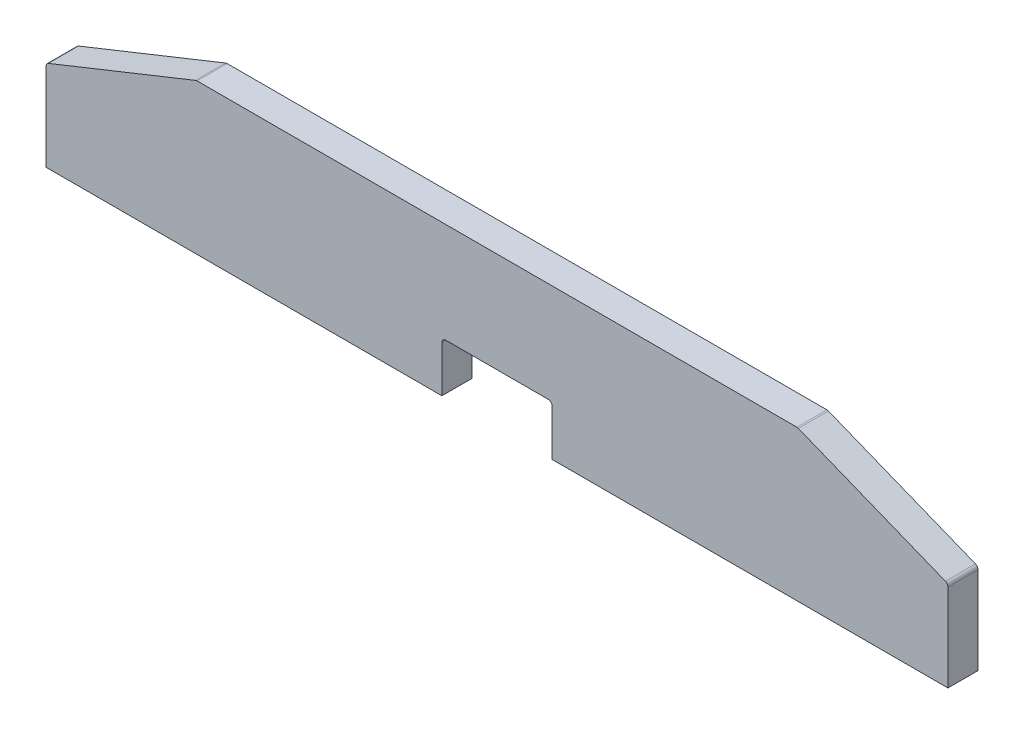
ISO-10303-21;
HEADER;
FILE_DESCRIPTION(('STEP AP214'),'2;1');
FILE_NAME('part.step','',(''),(''),'','','');
FILE_SCHEMA(('AUTOMOTIVE_DESIGN { 1 0 10303 214 1 1 1 1 }'));
ENDSEC;
DATA;
#1=APPLICATION_CONTEXT('core data for automotive mechanical design processes');
#2=APPLICATION_PROTOCOL_DEFINITION('international standard','automotive_design',2000,#1);
#3=PRODUCT_CONTEXT('',#1,'mechanical');
#4=PRODUCT('Part','Part','',(#3));
#5=PRODUCT_RELATED_PRODUCT_CATEGORY('part','',(#4));
#6=PRODUCT_DEFINITION_FORMATION('','',#4);
#7=PRODUCT_DEFINITION_CONTEXT('part definition',#1,'design');
#8=PRODUCT_DEFINITION('design','',#6,#7);
#9=PRODUCT_DEFINITION_SHAPE('','',#8);
#10=(LENGTH_UNIT() NAMED_UNIT(*) SI_UNIT(.MILLI.,.METRE.));
#11=(NAMED_UNIT(*) PLANE_ANGLE_UNIT() SI_UNIT($,.RADIAN.));
#12=(NAMED_UNIT(*) SI_UNIT($,.STERADIAN.) SOLID_ANGLE_UNIT());
#13=UNCERTAINTY_MEASURE_WITH_UNIT(LENGTH_MEASURE(1.E-05),#10,'distance_accuracy_value','');
#14=(GEOMETRIC_REPRESENTATION_CONTEXT(3) GLOBAL_UNCERTAINTY_ASSIGNED_CONTEXT((#13)) GLOBAL_UNIT_ASSIGNED_CONTEXT((#10,
#11,#12)) REPRESENTATION_CONTEXT('',''));
#15=CARTESIAN_POINT('',(0.,0.,0.));
#16=DIRECTION('',(0.,0.,1.));
#17=DIRECTION('',(1.,0.,0.));
#18=AXIS2_PLACEMENT_3D('',#15,#16,#17);
#19=CARTESIAN_POINT('',(0.,0.,0.));
#20=DIRECTION('',(0.,0.,-1.));
#21=DIRECTION('',(-1.,0.,0.));
#22=AXIS2_PLACEMENT_3D('',#19,#20,#21);
#23=PLANE('',#22);
#24=DIRECTION('',(-1.,0.,0.));
#25=VECTOR('',#24,1.);
#26=CARTESIAN_POINT('',(300.,72.0000000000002,0.));
#27=LINE('',#26,#25);
#28=CARTESIAN_POINT('',(300.,72.0000000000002,0.));
#29=VERTEX_POINT('',#28);
#30=CARTESIAN_POINT('',(280.,72.0000000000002,0.));
#31=VERTEX_POINT('',#30);
#32=EDGE_CURVE('E370',#29,#31,#27,.T.);
#33=ORIENTED_EDGE('',*,*,#32,.T.);
#34=DIRECTION('',(0.,-1.,0.));
#35=VECTOR('',#34,1.);
#36=CARTESIAN_POINT('',(280.,72.0000000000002,0.));
#37=LINE('',#36,#35);
#38=CARTESIAN_POINT('',(280.,52.0000000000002,0.));
#39=VERTEX_POINT('',#38);
#40=EDGE_CURVE('E55',#31,#39,#37,.T.);
#41=ORIENTED_EDGE('',*,*,#40,.T.);
#42=DIRECTION('',(1.,0.,0.));
#43=VECTOR('',#42,1.);
#44=CARTESIAN_POINT('',(280.,52.0000000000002,0.));
#45=LINE('',#44,#43);
#46=CARTESIAN_POINT('',(300.,52.0000000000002,0.));
#47=VERTEX_POINT('',#46);
#48=EDGE_CURVE('E360',#39,#47,#45,.T.);
#49=ORIENTED_EDGE('',*,*,#48,.T.);
#50=DIRECTION('',(0.,1.,0.));
#51=VECTOR('',#50,1.);
#52=CARTESIAN_POINT('',(300.,52.0000000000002,0.));
#53=LINE('',#52,#51);
#54=EDGE_CURVE('E379',#47,#29,#53,.T.);
#55=ORIENTED_EDGE('',*,*,#54,.T.);
#56=EDGE_LOOP('',(#33,#41,#49,#55));
#57=FACE_BOUND('',#56,.T.);
#58=DIRECTION('',(-1.,0.,0.));
#59=VECTOR('',#58,1.);
#60=CARTESIAN_POINT('',(125.,72.,0.));
#61=LINE('',#60,#59);
#62=CARTESIAN_POINT('',(125.,72.,0.));
#63=VERTEX_POINT('',#62);
#64=CARTESIAN_POINT('',(105.,72.,0.));
#65=VERTEX_POINT('',#64);
#66=EDGE_CURVE('E427',#63,#65,#61,.T.);
#67=ORIENTED_EDGE('',*,*,#66,.T.);
#68=DIRECTION('',(0.,-1.,0.));
#69=VECTOR('',#68,1.);
#70=CARTESIAN_POINT('',(105.,72.,0.));
#71=LINE('',#70,#69);
#72=CARTESIAN_POINT('',(105.,52.,0.));
#73=VERTEX_POINT('',#72);
#74=EDGE_CURVE('E422',#65,#73,#71,.T.);
#75=ORIENTED_EDGE('',*,*,#74,.T.);
#76=DIRECTION('',(1.,0.,0.));
#77=VECTOR('',#76,1.);
#78=CARTESIAN_POINT('',(105.,52.,0.));
#79=LINE('',#78,#77);
#80=CARTESIAN_POINT('',(125.,52.,0.));
#81=VERTEX_POINT('',#80);
#82=EDGE_CURVE('E436',#73,#81,#79,.T.);
#83=ORIENTED_EDGE('',*,*,#82,.T.);
#84=DIRECTION('',(0.,1.,0.));
#85=VECTOR('',#84,1.);
#86=CARTESIAN_POINT('',(125.,52.,0.));
#87=LINE('',#86,#85);
#88=EDGE_CURVE('E439',#81,#63,#87,.T.);
#89=ORIENTED_EDGE('',*,*,#88,.T.);
#90=EDGE_LOOP('',(#67,#75,#83,#89));
#91=FACE_BOUND('',#90,.T.);
#92=DIRECTION('',(0.,1.,0.));
#93=VECTOR('',#92,1.);
#94=CARTESIAN_POINT('',(-280.,-9.99999999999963,0.));
#95=LINE('',#94,#93);
#96=CARTESIAN_POINT('',(-280.,-9.99999999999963,0.));
#97=VERTEX_POINT('',#96);
#98=CARTESIAN_POINT('',(-280.,10.0000000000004,0.));
#99=VERTEX_POINT('',#98);
#100=EDGE_CURVE('E489',#97,#99,#95,.T.);
#101=ORIENTED_EDGE('',*,*,#100,.T.);
#102=DIRECTION('',(-1.,0.,0.));
#103=VECTOR('',#102,1.);
#104=CARTESIAN_POINT('',(-280.,10.0000000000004,0.));
#105=LINE('',#104,#103);
#106=CARTESIAN_POINT('',(-300.,10.0000000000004,0.));
#107=VERTEX_POINT('',#106);
#108=EDGE_CURVE('E484',#99,#107,#105,.T.);
#109=ORIENTED_EDGE('',*,*,#108,.T.);
#110=DIRECTION('',(0.,-1.,0.));
#111=VECTOR('',#110,1.);
#112=CARTESIAN_POINT('',(-300.,10.0000000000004,0.));
#113=LINE('',#112,#111);
#114=CARTESIAN_POINT('',(-300.,-9.99999999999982,0.));
#115=VERTEX_POINT('',#114);
#116=EDGE_CURVE('E498',#107,#115,#113,.T.);
#117=ORIENTED_EDGE('',*,*,#116,.T.);
#118=DIRECTION('',(1.,0.,0.));
#119=VECTOR('',#118,1.);
#120=CARTESIAN_POINT('',(-300.,-9.99999999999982,0.));
#121=LINE('',#120,#119);
#122=EDGE_CURVE('E501',#115,#97,#121,.T.);
#123=ORIENTED_EDGE('',*,*,#122,.T.);
#124=EDGE_LOOP('',(#101,#109,#117,#123));
#125=FACE_BOUND('',#124,.T.);
#126=DIRECTION('',(-1.,0.,0.));
#127=VECTOR('',#126,1.);
#128=CARTESIAN_POINT('',(280.,10.0000000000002,0.));
#129=LINE('',#128,#127);
#130=CARTESIAN_POINT('',(300.,10.0000000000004,0.));
#131=VERTEX_POINT('',#130);
#132=CARTESIAN_POINT('',(280.,10.0000000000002,0.));
#133=VERTEX_POINT('',#132);
#134=EDGE_CURVE('E551',#131,#133,#129,.T.);
#135=ORIENTED_EDGE('',*,*,#134,.T.);
#136=DIRECTION('',(0.,-1.,0.));
#137=VECTOR('',#136,1.);
#138=CARTESIAN_POINT('',(280.,-9.99999999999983,0.));
#139=LINE('',#138,#137);
#140=CARTESIAN_POINT('',(280.,-9.99999999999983,0.));
#141=VERTEX_POINT('',#140);
#142=EDGE_CURVE('E546',#133,#141,#139,.T.);
#143=ORIENTED_EDGE('',*,*,#142,.T.);
#144=DIRECTION('',(1.,0.,0.));
#145=VECTOR('',#144,1.);
#146=CARTESIAN_POINT('',(300.,-9.99999999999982,0.));
#147=LINE('',#146,#145);
#148=CARTESIAN_POINT('',(300.,-9.99999999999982,0.));
#149=VERTEX_POINT('',#148);
#150=EDGE_CURVE('E560',#141,#149,#147,.T.);
#151=ORIENTED_EDGE('',*,*,#150,.T.);
#152=DIRECTION('',(0.,1.,0.));
#153=VECTOR('',#152,1.);
#154=CARTESIAN_POINT('',(300.,10.0000000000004,0.));
#155=LINE('',#154,#153);
#156=EDGE_CURVE('E563',#149,#131,#155,.T.);
#157=ORIENTED_EDGE('',*,*,#156,.T.);
#158=EDGE_LOOP('',(#135,#143,#151,#157));
#159=FACE_BOUND('',#158,.T.);
#160=DIRECTION('',(0.,-1.,0.));
#161=VECTOR('',#160,1.);
#162=CARTESIAN_POINT('',(-450.,-50.,0.));
#163=LINE('',#162,#161);
#164=CARTESIAN_POINT('',(-450.,37.2918681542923,0.));
#165=VERTEX_POINT('',#164);
#166=CARTESIAN_POINT('',(-450.,-50.,0.));
#167=VERTEX_POINT('',#166);
#168=EDGE_CURVE('E577',#165,#167,#163,.T.);
#169=ORIENTED_EDGE('',*,*,#168,.F.);
#170=CARTESIAN_POINT('',(-446.,37.2918681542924,0.));
#171=DIRECTION('',(0.,0.,-1.));
#172=DIRECTION('',(-1.,0.,0.));
#173=AXIS2_PLACEMENT_3D('',#170,#171,#172);
#174=CIRCLE('',#173,4.);
#175=CARTESIAN_POINT('',(-447.485562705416,41.0057749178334,0.));
#176=VERTEX_POINT('',#175);
#177=EDGE_CURVE('E689',#165,#176,#174,.T.);
#178=ORIENTED_EDGE('',*,*,#177,.T.);
#179=DIRECTION('',(-0.928476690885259,-0.371390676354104,0.));
#180=VECTOR('',#179,1.);
#181=CARTESIAN_POINT('',(-450.,40.,0.));
#182=LINE('',#181,#180);
#183=CARTESIAN_POINT('',(-300.715233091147,99.713906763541,0.));
#184=VERTEX_POINT('',#183);
#185=EDGE_CURVE('E581',#184,#176,#182,.T.);
#186=ORIENTED_EDGE('',*,*,#185,.F.);
#187=CARTESIAN_POINT('',(-299.229670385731,95.9999999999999,0.));
#188=DIRECTION('',(0.,0.,-1.));
#189=DIRECTION('',(-1.,0.,0.));
#190=AXIS2_PLACEMENT_3D('',#187,#188,#189);
#191=CIRCLE('',#190,4.);
#192=CARTESIAN_POINT('',(-299.229670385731,99.9999999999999,0.));
#193=VERTEX_POINT('',#192);
#194=EDGE_CURVE('E680',#184,#193,#191,.T.);
#195=ORIENTED_EDGE('',*,*,#194,.T.);
#196=DIRECTION('',(-1.,0.,0.));
#197=VECTOR('',#196,1.);
#198=CARTESIAN_POINT('',(-300.,99.9999999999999,0.));
#199=LINE('',#198,#197);
#200=CARTESIAN_POINT('',(299.229670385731,99.9999999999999,0.));
#201=VERTEX_POINT('',#200);
#202=EDGE_CURVE('E621',#201,#193,#199,.T.);
#203=ORIENTED_EDGE('',*,*,#202,.F.);
#204=CARTESIAN_POINT('',(299.229670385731,95.9999999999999,0.));
#205=DIRECTION('',(0.,0.,-1.));
#206=DIRECTION('',(-1.,0.,0.));
#207=AXIS2_PLACEMENT_3D('',#204,#205,#206);
#208=CIRCLE('',#207,4.);
#209=CARTESIAN_POINT('',(300.715233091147,99.713906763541,0.));
#210=VERTEX_POINT('',#209);
#211=EDGE_CURVE('E660',#201,#210,#208,.T.);
#212=ORIENTED_EDGE('',*,*,#211,.T.);
#213=DIRECTION('',(-0.928476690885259,0.371390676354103,0.));
#214=VECTOR('',#213,1.);
#215=CARTESIAN_POINT('',(300.,99.9999999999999,0.));
#216=LINE('',#215,#214);
#217=CARTESIAN_POINT('',(447.485562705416,41.0057749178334,0.));
#218=VERTEX_POINT('',#217);
#219=EDGE_CURVE('E619',#218,#210,#216,.T.);
#220=ORIENTED_EDGE('',*,*,#219,.F.);
#221=CARTESIAN_POINT('',(446.,37.2918681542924,0.));
#222=DIRECTION('',(0.,0.,-1.));
#223=DIRECTION('',(-1.,0.,0.));
#224=AXIS2_PLACEMENT_3D('',#221,#222,#223);
#225=CIRCLE('',#224,4.);
#226=CARTESIAN_POINT('',(450.,37.2918681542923,0.));
#227=VERTEX_POINT('',#226);
#228=EDGE_CURVE('E671',#218,#227,#225,.T.);
#229=ORIENTED_EDGE('',*,*,#228,.T.);
#230=DIRECTION('',(0.,1.,0.));
#231=VECTOR('',#230,1.);
#232=CARTESIAN_POINT('',(450.,-50.,0.));
#233=LINE('',#232,#231);
#234=CARTESIAN_POINT('',(450.,-50.,0.));
#235=VERTEX_POINT('',#234);
#236=EDGE_CURVE('E616',#235,#227,#233,.T.);
#237=ORIENTED_EDGE('',*,*,#236,.F.);
#238=DIRECTION('',(1.,0.,0.));
#239=VECTOR('',#238,1.);
#240=CARTESIAN_POINT('',(55.,-50.,0.));
#241=LINE('',#240,#239);
#242=CARTESIAN_POINT('',(55.,-50.,0.));
#243=VERTEX_POINT('',#242);
#244=EDGE_CURVE('E614',#243,#235,#241,.T.);
#245=ORIENTED_EDGE('',*,*,#244,.F.);
#246=DIRECTION('',(0.,-1.,0.));
#247=VECTOR('',#246,1.);
#248=CARTESIAN_POINT('',(55.,0.,0.));
#249=LINE('',#248,#247);
#250=CARTESIAN_POINT('',(55.,-4.,0.));
#251=VERTEX_POINT('',#250);
#252=EDGE_CURVE('E612',#251,#243,#249,.T.);
#253=ORIENTED_EDGE('',*,*,#252,.F.);
#254=CARTESIAN_POINT('',(51.,-4.,0.));
#255=DIRECTION('',(0.,0.,-1.));
#256=DIRECTION('',(-1.,0.,0.));
#257=AXIS2_PLACEMENT_3D('',#254,#255,#256);
#258=CIRCLE('',#257,4.);
#259=CARTESIAN_POINT('',(51.,0.,0.));
#260=VERTEX_POINT('',#259);
#261=EDGE_CURVE('E643',#251,#260,#258,.F.);
#262=ORIENTED_EDGE('',*,*,#261,.T.);
#263=DIRECTION('',(1.,0.,0.));
#264=VECTOR('',#263,1.);
#265=CARTESIAN_POINT('',(-55.,0.,0.));
#266=LINE('',#265,#264);
#267=CARTESIAN_POINT('',(-51.,0.,0.));
#268=VERTEX_POINT('',#267);
#269=EDGE_CURVE('E610',#268,#260,#266,.T.);
#270=ORIENTED_EDGE('',*,*,#269,.F.);
#271=CARTESIAN_POINT('',(-51.,-4.,0.));
#272=DIRECTION('',(0.,0.,-1.));
#273=DIRECTION('',(-1.,0.,0.));
#274=AXIS2_PLACEMENT_3D('',#271,#272,#273);
#275=CIRCLE('',#274,4.);
#276=CARTESIAN_POINT('',(-55.,-4.,0.));
#277=VERTEX_POINT('',#276);
#278=EDGE_CURVE('E653',#268,#277,#275,.F.);
#279=ORIENTED_EDGE('',*,*,#278,.T.);
#280=DIRECTION('',(0.,1.,0.));
#281=VECTOR('',#280,1.);
#282=CARTESIAN_POINT('',(-55.,-50.,0.));
#283=LINE('',#282,#281);
#284=CARTESIAN_POINT('',(-55.,-50.,0.));
#285=VERTEX_POINT('',#284);
#286=EDGE_CURVE('E607',#285,#277,#283,.T.);
#287=ORIENTED_EDGE('',*,*,#286,.F.);
#288=DIRECTION('',(1.,0.,0.));
#289=VECTOR('',#288,1.);
#290=CARTESIAN_POINT('',(-450.,-50.,0.));
#291=LINE('',#290,#289);
#292=EDGE_CURVE('E605',#167,#285,#291,.T.);
#293=ORIENTED_EDGE('',*,*,#292,.F.);
#294=EDGE_LOOP('',(#169,#178,#186,#195,#203,#212,#220,#229,#237,#245,#253,#262,#270,#279,#287,#293));
#295=FACE_BOUND('',#294,.T.);
#296=DIRECTION('',(0.,-1.,0.));
#297=VECTOR('',#296,1.);
#298=CARTESIAN_POINT('',(-300.,52.0000000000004,0.));
#299=LINE('',#298,#297);
#300=CARTESIAN_POINT('',(-300.,72.0000000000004,0.));
#301=VERTEX_POINT('',#300);
#302=CARTESIAN_POINT('',(-300.,52.0000000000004,0.));
#303=VERTEX_POINT('',#302);
#304=EDGE_CURVE('E520',#301,#303,#299,.T.);
#305=ORIENTED_EDGE('',*,*,#304,.T.);
#306=DIRECTION('',(1.,0.,0.));
#307=VECTOR('',#306,1.);
#308=CARTESIAN_POINT('',(-280.,52.0000000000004,0.));
#309=LINE('',#308,#307);
#310=CARTESIAN_POINT('',(-280.,52.0000000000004,0.));
#311=VERTEX_POINT('',#310);
#312=EDGE_CURVE('E515',#303,#311,#309,.T.);
#313=ORIENTED_EDGE('',*,*,#312,.T.);
#314=DIRECTION('',(0.,1.,0.));
#315=VECTOR('',#314,1.);
#316=CARTESIAN_POINT('',(-280.,72.0000000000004,0.));
#317=LINE('',#316,#315);
#318=CARTESIAN_POINT('',(-280.,72.0000000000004,0.));
#319=VERTEX_POINT('',#318);
#320=EDGE_CURVE('E529',#311,#319,#317,.T.);
#321=ORIENTED_EDGE('',*,*,#320,.T.);
#322=DIRECTION('',(-1.,0.,0.));
#323=VECTOR('',#322,1.);
#324=CARTESIAN_POINT('',(-300.,72.0000000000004,0.));
#325=LINE('',#324,#323);
#326=EDGE_CURVE('E532',#319,#301,#325,.T.);
#327=ORIENTED_EDGE('',*,*,#326,.T.);
#328=EDGE_LOOP('',(#305,#313,#321,#327));
#329=FACE_BOUND('',#328,.T.);
#330=DIRECTION('',(-1.,0.,0.));
#331=VECTOR('',#330,1.);
#332=CARTESIAN_POINT('',(105.,10.0000000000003,0.));
#333=LINE('',#332,#331);
#334=CARTESIAN_POINT('',(125.,10.0000000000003,0.));
#335=VERTEX_POINT('',#334);
#336=CARTESIAN_POINT('',(105.,10.0000000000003,0.));
#337=VERTEX_POINT('',#336);
#338=EDGE_CURVE('E458',#335,#337,#333,.T.);
#339=ORIENTED_EDGE('',*,*,#338,.T.);
#340=DIRECTION('',(0.,-1.,0.));
#341=VECTOR('',#340,1.);
#342=CARTESIAN_POINT('',(105.,-9.99999999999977,0.));
#343=LINE('',#342,#341);
#344=CARTESIAN_POINT('',(105.,-9.99999999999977,0.));
#345=VERTEX_POINT('',#344);
#346=EDGE_CURVE('E453',#337,#345,#343,.T.);
#347=ORIENTED_EDGE('',*,*,#346,.T.);
#348=DIRECTION('',(1.,0.,0.));
#349=VECTOR('',#348,1.);
#350=CARTESIAN_POINT('',(125.,-9.99999999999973,0.));
#351=LINE('',#350,#349);
#352=CARTESIAN_POINT('',(125.,-9.99999999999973,0.));
#353=VERTEX_POINT('',#352);
#354=EDGE_CURVE('E467',#345,#353,#351,.T.);
#355=ORIENTED_EDGE('',*,*,#354,.T.);
#356=DIRECTION('',(0.,1.,0.));
#357=VECTOR('',#356,1.);
#358=CARTESIAN_POINT('',(125.,10.0000000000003,0.));
#359=LINE('',#358,#357);
#360=EDGE_CURVE('E470',#353,#335,#359,.T.);
#361=ORIENTED_EDGE('',*,*,#360,.T.);
#362=EDGE_LOOP('',(#339,#347,#355,#361));
#363=FACE_BOUND('',#362,.T.);
#364=DIRECTION('',(0.,-1.,0.));
#365=VECTOR('',#364,1.);
#366=CARTESIAN_POINT('',(-125.,52.0000000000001,0.));
#367=LINE('',#366,#365);
#368=CARTESIAN_POINT('',(-125.,72.0000000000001,0.));
#369=VERTEX_POINT('',#368);
#370=CARTESIAN_POINT('',(-125.,52.0000000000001,0.));
#371=VERTEX_POINT('',#370);
#372=EDGE_CURVE('E396',#369,#371,#367,.T.);
#373=ORIENTED_EDGE('',*,*,#372,.T.);
#374=DIRECTION('',(1.,0.,0.));
#375=VECTOR('',#374,1.);
#376=CARTESIAN_POINT('',(-105.,52.,0.));
#377=LINE('',#376,#375);
#378=CARTESIAN_POINT('',(-105.,52.,0.));
#379=VERTEX_POINT('',#378);
#380=EDGE_CURVE('E391',#371,#379,#377,.T.);
#381=ORIENTED_EDGE('',*,*,#380,.T.);
#382=DIRECTION('',(0.,1.,0.));
#383=VECTOR('',#382,1.);
#384=CARTESIAN_POINT('',(-105.,72.0000000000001,0.));
#385=LINE('',#384,#383);
#386=CARTESIAN_POINT('',(-105.,72.0000000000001,0.));
#387=VERTEX_POINT('',#386);
#388=EDGE_CURVE('E405',#379,#387,#385,.T.);
#389=ORIENTED_EDGE('',*,*,#388,.T.);
#390=DIRECTION('',(-1.,0.,0.));
#391=VECTOR('',#390,1.);
#392=CARTESIAN_POINT('',(-125.,72.0000000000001,0.));
#393=LINE('',#392,#391);
#394=EDGE_CURVE('E408',#387,#369,#393,.T.);
#395=ORIENTED_EDGE('',*,*,#394,.T.);
#396=EDGE_LOOP('',(#373,#381,#389,#395));
#397=FACE_BOUND('',#396,.T.);
#398=DIRECTION('',(0.,1.,0.));
#399=VECTOR('',#398,1.);
#400=CARTESIAN_POINT('',(-105.,-9.99999999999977,0.));
#401=LINE('',#400,#399);
#402=CARTESIAN_POINT('',(-105.,-9.99999999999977,0.));
#403=VERTEX_POINT('',#402);
#404=CARTESIAN_POINT('',(-105.,10.0000000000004,0.));
#405=VERTEX_POINT('',#404);
#406=EDGE_CURVE('E353',#403,#405,#401,.T.);
#407=ORIENTED_EDGE('',*,*,#406,.T.);
#408=DIRECTION('',(-1.,0.,0.));
#409=VECTOR('',#408,1.);
#410=CARTESIAN_POINT('',(-105.,10.0000000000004,0.));
#411=LINE('',#410,#409);
#412=CARTESIAN_POINT('',(-125.,10.0000000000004,0.));
#413=VERTEX_POINT('',#412);
#414=EDGE_CURVE('E47',#405,#413,#411,.T.);
#415=ORIENTED_EDGE('',*,*,#414,.T.);
#416=DIRECTION('',(0.,-1.,0.));
#417=VECTOR('',#416,1.);
#418=CARTESIAN_POINT('',(-125.,10.0000000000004,0.));
#419=LINE('',#418,#417);
#420=CARTESIAN_POINT('',(-125.,-9.99999999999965,0.));
#421=VERTEX_POINT('',#420);
#422=EDGE_CURVE('E357',#413,#421,#419,.T.);
#423=ORIENTED_EDGE('',*,*,#422,.T.);
#424=DIRECTION('',(1.,0.,0.));
#425=VECTOR('',#424,1.);
#426=CARTESIAN_POINT('',(-125.,-9.99999999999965,0.));
#427=LINE('',#426,#425);
#428=EDGE_CURVE('E1261',#421,#403,#427,.T.);
#429=ORIENTED_EDGE('',*,*,#428,.T.);
#430=EDGE_LOOP('',(#407,#415,#423,#429));
#431=FACE_BOUND('',#430,.T.);
#432=ADVANCED_FACE('F32',(#57,#91,#125,#159,#295,#329,#363,#397,#431),#23,.T.);
#433=CARTESIAN_POINT('',(-450.,-50.,30.));
#434=DIRECTION('',(1.,0.,0.));
#435=DIRECTION('',(0.,0.,-1.));
#436=AXIS2_PLACEMENT_3D('',#433,#434,#435);
#437=PLANE('',#436);
#438=DIRECTION('',(0.,-1.,0.));
#439=VECTOR('',#438,1.);
#440=CARTESIAN_POINT('',(-450.,-50.,30.));
#441=LINE('',#440,#439);
#442=CARTESIAN_POINT('',(-450.,37.2918681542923,30.));
#443=VERTEX_POINT('',#442);
#444=CARTESIAN_POINT('',(-450.,-50.,30.));
#445=VERTEX_POINT('',#444);
#446=EDGE_CURVE('E578',#443,#445,#441,.T.);
#447=ORIENTED_EDGE('',*,*,#446,.F.);
#448=DIRECTION('',(0.,0.,-1.));
#449=VECTOR('',#448,1.);
#450=CARTESIAN_POINT('',(-450.,37.2918681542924,30.));
#451=LINE('',#450,#449);
#452=EDGE_CURVE('E686',#443,#165,#451,.T.);
#453=ORIENTED_EDGE('',*,*,#452,.T.);
#454=ORIENTED_EDGE('',*,*,#168,.T.);
#455=DIRECTION('',(0.,0.,-1.));
#456=VECTOR('',#455,1.);
#457=CARTESIAN_POINT('',(-450.,-50.,30.));
#458=LINE('',#457,#456);
#459=EDGE_CURVE('E634',#445,#167,#458,.T.);
#460=ORIENTED_EDGE('',*,*,#459,.F.);
#461=EDGE_LOOP('',(#447,#453,#454,#460));
#462=FACE_BOUND('',#461,.T.);
#463=ADVANCED_FACE('F705',(#462),#437,.F.);
#464=CARTESIAN_POINT('',(-450.,-50.,30.));
#465=DIRECTION('',(0.,1.,0.));
#466=DIRECTION('',(-1.,0.,0.));
#467=AXIS2_PLACEMENT_3D('',#464,#465,#466);
#468=PLANE('',#467);
#469=ORIENTED_EDGE('',*,*,#292,.T.);
#470=DIRECTION('',(0.,0.,-1.));
#471=VECTOR('',#470,1.);
#472=CARTESIAN_POINT('',(-55.,-50.,30.));
#473=LINE('',#472,#471);
#474=CARTESIAN_POINT('',(-55.,-50.,30.));
#475=VERTEX_POINT('',#474);
#476=EDGE_CURVE('E631',#475,#285,#473,.T.);
#477=ORIENTED_EDGE('',*,*,#476,.F.);
#478=DIRECTION('',(1.,0.,0.));
#479=VECTOR('',#478,1.);
#480=CARTESIAN_POINT('',(-450.,-50.,30.));
#481=LINE('',#480,#479);
#482=EDGE_CURVE('E580',#445,#475,#481,.T.);
#483=ORIENTED_EDGE('',*,*,#482,.F.);
#484=ORIENTED_EDGE('',*,*,#459,.T.);
#485=EDGE_LOOP('',(#469,#477,#483,#484));
#486=FACE_BOUND('',#485,.T.);
#487=ADVANCED_FACE('F714',(#486),#468,.F.);
#488=CARTESIAN_POINT('',(-55.,-50.,30.));
#489=DIRECTION('',(-1.,0.,0.));
#490=DIRECTION('',(0.,0.,1.));
#491=AXIS2_PLACEMENT_3D('',#488,#489,#490);
#492=PLANE('',#491);
#493=ORIENTED_EDGE('',*,*,#286,.T.);
#494=DIRECTION('',(0.,0.,-1.));
#495=VECTOR('',#494,1.);
#496=CARTESIAN_POINT('',(-55.,-4.,30.));
#497=LINE('',#496,#495);
#498=CARTESIAN_POINT('',(-55.,-4.,30.));
#499=VERTEX_POINT('',#498);
#500=EDGE_CURVE('E651',#277,#499,#497,.F.);
#501=ORIENTED_EDGE('',*,*,#500,.T.);
#502=DIRECTION('',(0.,1.,0.));
#503=VECTOR('',#502,1.);
#504=CARTESIAN_POINT('',(-55.,-50.,30.));
#505=LINE('',#504,#503);
#506=EDGE_CURVE('E583',#475,#499,#505,.T.);
#507=ORIENTED_EDGE('',*,*,#506,.F.);
#508=ORIENTED_EDGE('',*,*,#476,.T.);
#509=EDGE_LOOP('',(#493,#501,#507,#508));
#510=FACE_BOUND('',#509,.T.);
#511=ADVANCED_FACE('F798',(#510),#492,.F.);
#512=CARTESIAN_POINT('',(-55.,0.,30.));
#513=DIRECTION('',(0.,1.,0.));
#514=DIRECTION('',(0.,0.,1.));
#515=AXIS2_PLACEMENT_3D('',#512,#513,#514);
#516=PLANE('',#515);
#517=DIRECTION('',(1.,0.,0.));
#518=VECTOR('',#517,1.);
#519=CARTESIAN_POINT('',(-55.,0.,30.));
#520=LINE('',#519,#518);
#521=CARTESIAN_POINT('',(-51.,0.,30.));
#522=VERTEX_POINT('',#521);
#523=CARTESIAN_POINT('',(51.,0.,30.));
#524=VERTEX_POINT('',#523);
#525=EDGE_CURVE('E586',#522,#524,#520,.T.);
#526=ORIENTED_EDGE('',*,*,#525,.F.);
#527=DIRECTION('',(0.,0.,-1.));
#528=VECTOR('',#527,1.);
#529=CARTESIAN_POINT('',(-51.,0.,0.));
#530=LINE('',#529,#528);
#531=EDGE_CURVE('E648',#522,#268,#530,.T.);
#532=ORIENTED_EDGE('',*,*,#531,.T.);
#533=ORIENTED_EDGE('',*,*,#269,.T.);
#534=DIRECTION('',(0.,0.,-1.));
#535=VECTOR('',#534,1.);
#536=CARTESIAN_POINT('',(51.,0.,30.));
#537=LINE('',#536,#535);
#538=EDGE_CURVE('E640',#260,#524,#537,.F.);
#539=ORIENTED_EDGE('',*,*,#538,.T.);
#540=EDGE_LOOP('',(#526,#532,#533,#539));
#541=FACE_BOUND('',#540,.T.);
#542=ADVANCED_FACE('F725',(#541),#516,.F.);
#543=CARTESIAN_POINT('',(55.,0.,30.));
#544=DIRECTION('',(1.,0.,0.));
#545=DIRECTION('',(0.,0.,-1.));
#546=AXIS2_PLACEMENT_3D('',#543,#544,#545);
#547=PLANE('',#546);
#548=DIRECTION('',(0.,-1.,0.));
#549=VECTOR('',#548,1.);
#550=CARTESIAN_POINT('',(55.,0.,30.));
#551=LINE('',#550,#549);
#552=CARTESIAN_POINT('',(55.,-4.,30.));
#553=VERTEX_POINT('',#552);
#554=CARTESIAN_POINT('',(55.,-50.,30.));
#555=VERTEX_POINT('',#554);
#556=EDGE_CURVE('E588',#553,#555,#551,.T.);
#557=ORIENTED_EDGE('',*,*,#556,.F.);
#558=DIRECTION('',(0.,0.,-1.));
#559=VECTOR('',#558,1.);
#560=CARTESIAN_POINT('',(55.,-4.,0.));
#561=LINE('',#560,#559);
#562=EDGE_CURVE('E637',#553,#251,#561,.T.);
#563=ORIENTED_EDGE('',*,*,#562,.T.);
#564=ORIENTED_EDGE('',*,*,#252,.T.);
#565=DIRECTION('',(0.,0.,-1.));
#566=VECTOR('',#565,1.);
#567=CARTESIAN_POINT('',(55.,-50.,30.));
#568=LINE('',#567,#566);
#569=EDGE_CURVE('E628',#555,#243,#568,.T.);
#570=ORIENTED_EDGE('',*,*,#569,.F.);
#571=EDGE_LOOP('',(#557,#563,#564,#570));
#572=FACE_BOUND('',#571,.T.);
#573=ADVANCED_FACE('F736',(#572),#547,.F.);
#574=CARTESIAN_POINT('',(55.,-50.,30.));
#575=DIRECTION('',(0.,1.,0.));
#576=DIRECTION('',(-1.,0.,0.));
#577=AXIS2_PLACEMENT_3D('',#574,#575,#576);
#578=PLANE('',#577);
#579=ORIENTED_EDGE('',*,*,#244,.T.);
#580=DIRECTION('',(0.,0.,-1.));
#581=VECTOR('',#580,1.);
#582=CARTESIAN_POINT('',(450.,-50.,30.));
#583=LINE('',#582,#581);
#584=CARTESIAN_POINT('',(450.,-50.,30.));
#585=VERTEX_POINT('',#584);
#586=EDGE_CURVE('E603',#585,#235,#583,.T.);
#587=ORIENTED_EDGE('',*,*,#586,.F.);
#588=DIRECTION('',(1.,0.,0.));
#589=VECTOR('',#588,1.);
#590=CARTESIAN_POINT('',(55.,-50.,30.));
#591=LINE('',#590,#589);
#592=EDGE_CURVE('E590',#555,#585,#591,.T.);
#593=ORIENTED_EDGE('',*,*,#592,.F.);
#594=ORIENTED_EDGE('',*,*,#569,.T.);
#595=EDGE_LOOP('',(#579,#587,#593,#594));
#596=FACE_BOUND('',#595,.T.);
#597=ADVANCED_FACE('F740',(#596),#578,.F.);
#598=CARTESIAN_POINT('',(450.,-50.,30.));
#599=DIRECTION('',(-1.,0.,0.));
#600=DIRECTION('',(0.,0.,1.));
#601=AXIS2_PLACEMENT_3D('',#598,#599,#600);
#602=PLANE('',#601);
#603=ORIENTED_EDGE('',*,*,#236,.T.);
#604=DIRECTION('',(0.,0.,-1.));
#605=VECTOR('',#604,1.);
#606=CARTESIAN_POINT('',(450.,37.2918681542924,30.));
#607=LINE('',#606,#605);
#608=CARTESIAN_POINT('',(450.,37.2918681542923,30.));
#609=VERTEX_POINT('',#608);
#610=EDGE_CURVE('E673',#227,#609,#607,.F.);
#611=ORIENTED_EDGE('',*,*,#610,.T.);
#612=DIRECTION('',(0.,1.,0.));
#613=VECTOR('',#612,1.);
#614=CARTESIAN_POINT('',(450.,-50.,30.));
#615=LINE('',#614,#613);
#616=EDGE_CURVE('E592',#585,#609,#615,.T.);
#617=ORIENTED_EDGE('',*,*,#616,.F.);
#618=ORIENTED_EDGE('',*,*,#586,.T.);
#619=EDGE_LOOP('',(#603,#611,#617,#618));
#620=FACE_BOUND('',#619,.T.);
#621=ADVANCED_FACE('F789',(#620),#602,.F.);
#622=CARTESIAN_POINT('',(300.,99.9999999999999,30.));
#623=DIRECTION('',(-0.371390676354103,-0.928476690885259,0.));
#624=DIRECTION('',(0.92847669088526,-0.371390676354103,0.));
#625=AXIS2_PLACEMENT_3D('',#622,#623,#624);
#626=PLANE('',#625);
#627=DIRECTION('',(-0.928476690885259,0.371390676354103,0.));
#628=VECTOR('',#627,1.);
#629=CARTESIAN_POINT('',(300.,99.9999999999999,30.));
#630=LINE('',#629,#628);
#631=CARTESIAN_POINT('',(447.485562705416,41.0057749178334,30.));
#632=VERTEX_POINT('',#631);
#633=CARTESIAN_POINT('',(300.715233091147,99.713906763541,30.));
#634=VERTEX_POINT('',#633);
#635=EDGE_CURVE('E595',#632,#634,#630,.T.);
#636=ORIENTED_EDGE('',*,*,#635,.F.);
#637=DIRECTION('',(0.,0.,-1.));
#638=VECTOR('',#637,1.);
#639=CARTESIAN_POINT('',(447.485562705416,41.0057749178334,30.));
#640=LINE('',#639,#638);
#641=EDGE_CURVE('E668',#632,#218,#640,.T.);
#642=ORIENTED_EDGE('',*,*,#641,.T.);
#643=ORIENTED_EDGE('',*,*,#219,.T.);
#644=DIRECTION('',(0.,0.,-1.));
#645=VECTOR('',#644,1.);
#646=CARTESIAN_POINT('',(300.715233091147,99.713906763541,30.));
#647=LINE('',#646,#645);
#648=EDGE_CURVE('E663',#210,#634,#647,.F.);
#649=ORIENTED_EDGE('',*,*,#648,.T.);
#650=EDGE_LOOP('',(#636,#642,#643,#649));
#651=FACE_BOUND('',#650,.T.);
#652=ADVANCED_FACE('F751',(#651),#626,.F.);
#653=CARTESIAN_POINT('',(-300.,99.9999999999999,30.));
#654=DIRECTION('',(0.,-1.,0.));
#655=DIRECTION('',(0.,0.,-1.));
#656=AXIS2_PLACEMENT_3D('',#653,#654,#655);
#657=PLANE('',#656);
#658=ORIENTED_EDGE('',*,*,#202,.T.);
#659=DIRECTION('',(0.,0.,-1.));
#660=VECTOR('',#659,1.);
#661=CARTESIAN_POINT('',(-299.229670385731,99.9999999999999,30.));
#662=LINE('',#661,#660);
#663=CARTESIAN_POINT('',(-299.229670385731,99.9999999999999,30.));
#664=VERTEX_POINT('',#663);
#665=EDGE_CURVE('E682',#193,#664,#662,.F.);
#666=ORIENTED_EDGE('',*,*,#665,.T.);
#667=DIRECTION('',(-1.,0.,0.));
#668=VECTOR('',#667,1.);
#669=CARTESIAN_POINT('',(-300.,99.9999999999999,30.));
#670=LINE('',#669,#668);
#671=CARTESIAN_POINT('',(299.229670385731,99.9999999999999,30.));
#672=VERTEX_POINT('',#671);
#673=EDGE_CURVE('E597',#672,#664,#670,.T.);
#674=ORIENTED_EDGE('',*,*,#673,.F.);
#675=DIRECTION('',(0.,0.,-1.));
#676=VECTOR('',#675,1.);
#677=CARTESIAN_POINT('',(299.229670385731,99.9999999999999,30.));
#678=LINE('',#677,#676);
#679=EDGE_CURVE('E657',#672,#201,#678,.T.);
#680=ORIENTED_EDGE('',*,*,#679,.T.);
#681=EDGE_LOOP('',(#658,#666,#674,#680));
#682=FACE_BOUND('',#681,.T.);
#683=ADVANCED_FACE('F761',(#682),#657,.F.);
#684=CARTESIAN_POINT('',(-450.,40.,30.));
#685=DIRECTION('',(0.371390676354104,-0.928476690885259,0.));
#686=DIRECTION('',(0.928476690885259,0.371390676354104,0.));
#687=AXIS2_PLACEMENT_3D('',#684,#685,#686);
#688=PLANE('',#687);
#689=ORIENTED_EDGE('',*,*,#185,.T.);
#690=DIRECTION('',(0.,0.,-1.));
#691=VECTOR('',#690,1.);
#692=CARTESIAN_POINT('',(-447.485562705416,41.0057749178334,30.));
#693=LINE('',#692,#691);
#694=CARTESIAN_POINT('',(-447.485562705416,41.0057749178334,30.));
#695=VERTEX_POINT('',#694);
#696=EDGE_CURVE('E40',#176,#695,#693,.F.);
#697=ORIENTED_EDGE('',*,*,#696,.T.);
#698=DIRECTION('',(-0.928476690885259,-0.371390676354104,0.));
#699=VECTOR('',#698,1.);
#700=CARTESIAN_POINT('',(-450.,40.,30.));
#701=LINE('',#700,#699);
#702=CARTESIAN_POINT('',(-300.715233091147,99.713906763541,30.));
#703=VERTEX_POINT('',#702);
#704=EDGE_CURVE('E600',#703,#695,#701,.T.);
#705=ORIENTED_EDGE('',*,*,#704,.F.);
#706=DIRECTION('',(0.,0.,-1.));
#707=VECTOR('',#706,1.);
#708=CARTESIAN_POINT('',(-300.715233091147,99.713906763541,30.));
#709=LINE('',#708,#707);
#710=EDGE_CURVE('E677',#703,#184,#709,.T.);
#711=ORIENTED_EDGE('',*,*,#710,.T.);
#712=EDGE_LOOP('',(#689,#697,#705,#711));
#713=FACE_BOUND('',#712,.T.);
#714=ADVANCED_FACE('F693',(#713),#688,.F.);
#715=CARTESIAN_POINT('',(0.,0.,30.));
#716=DIRECTION('',(0.,0.,-1.));
#717=DIRECTION('',(-1.,0.,0.));
#718=AXIS2_PLACEMENT_3D('',#715,#716,#717);
#719=PLANE('',#718);
#720=ORIENTED_EDGE('',*,*,#704,.T.);
#721=CARTESIAN_POINT('',(-446.,37.2918681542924,30.));
#722=DIRECTION('',(0.,0.,-1.));
#723=DIRECTION('',(-1.,0.,0.));
#724=AXIS2_PLACEMENT_3D('',#721,#722,#723);
#725=CIRCLE('',#724,4.);
#726=EDGE_CURVE('E11',#695,#443,#725,.F.);
#727=ORIENTED_EDGE('',*,*,#726,.T.);
#728=ORIENTED_EDGE('',*,*,#446,.T.);
#729=ORIENTED_EDGE('',*,*,#482,.T.);
#730=ORIENTED_EDGE('',*,*,#506,.T.);
#731=CARTESIAN_POINT('',(-51.,-4.,30.));
#732=DIRECTION('',(0.,0.,-1.));
#733=DIRECTION('',(-1.,0.,0.));
#734=AXIS2_PLACEMENT_3D('',#731,#732,#733);
#735=CIRCLE('',#734,4.);
#736=EDGE_CURVE('E655',#499,#522,#735,.T.);
#737=ORIENTED_EDGE('',*,*,#736,.T.);
#738=ORIENTED_EDGE('',*,*,#525,.T.);
#739=CARTESIAN_POINT('',(51.,-4.,30.));
#740=DIRECTION('',(0.,0.,-1.));
#741=DIRECTION('',(-1.,0.,0.));
#742=AXIS2_PLACEMENT_3D('',#739,#740,#741);
#743=CIRCLE('',#742,4.);
#744=EDGE_CURVE('E646',#524,#553,#743,.T.);
#745=ORIENTED_EDGE('',*,*,#744,.T.);
#746=ORIENTED_EDGE('',*,*,#556,.T.);
#747=ORIENTED_EDGE('',*,*,#592,.T.);
#748=ORIENTED_EDGE('',*,*,#616,.T.);
#749=CARTESIAN_POINT('',(446.,37.2918681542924,30.));
#750=DIRECTION('',(0.,0.,-1.));
#751=DIRECTION('',(-1.,0.,0.));
#752=AXIS2_PLACEMENT_3D('',#749,#750,#751);
#753=CIRCLE('',#752,4.);
#754=EDGE_CURVE('E675',#609,#632,#753,.F.);
#755=ORIENTED_EDGE('',*,*,#754,.T.);
#756=ORIENTED_EDGE('',*,*,#635,.T.);
#757=CARTESIAN_POINT('',(299.229670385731,95.9999999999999,30.));
#758=DIRECTION('',(0.,0.,-1.));
#759=DIRECTION('',(-1.,0.,0.));
#760=AXIS2_PLACEMENT_3D('',#757,#758,#759);
#761=CIRCLE('',#760,4.);
#762=EDGE_CURVE('E666',#634,#672,#761,.F.);
#763=ORIENTED_EDGE('',*,*,#762,.T.);
#764=ORIENTED_EDGE('',*,*,#673,.T.);
#765=CARTESIAN_POINT('',(-299.229670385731,95.9999999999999,30.));
#766=DIRECTION('',(0.,0.,-1.));
#767=DIRECTION('',(-1.,0.,0.));
#768=AXIS2_PLACEMENT_3D('',#765,#766,#767);
#769=CIRCLE('',#768,4.);
#770=EDGE_CURVE('E684',#664,#703,#769,.F.);
#771=ORIENTED_EDGE('',*,*,#770,.T.);
#772=EDGE_LOOP('',(#720,#727,#728,#729,#730,#737,#738,#745,#746,#747,#748,#755,#756,#763,#764,#771));
#773=FACE_BOUND('',#772,.T.);
#774=ADVANCED_FACE('F699',(#773),#719,.F.);
#775=CARTESIAN_POINT('',(51.,-4.,30.));
#776=DIRECTION('',(0.,0.,1.));
#777=DIRECTION('',(1.,0.,0.));
#778=AXIS2_PLACEMENT_3D('',#775,#776,#777);
#779=CYLINDRICAL_SURFACE('',#778,4.);
#780=ORIENTED_EDGE('',*,*,#744,.F.);
#781=ORIENTED_EDGE('',*,*,#538,.F.);
#782=ORIENTED_EDGE('',*,*,#261,.F.);
#783=ORIENTED_EDGE('',*,*,#562,.F.);
#784=EDGE_LOOP('',(#780,#781,#782,#783));
#785=FACE_BOUND('',#784,.T.);
#786=ADVANCED_FACE('F732',(#785),#779,.F.);
#787=CARTESIAN_POINT('',(-51.,-4.,30.));
#788=DIRECTION('',(0.,0.,1.));
#789=DIRECTION('',(1.,0.,0.));
#790=AXIS2_PLACEMENT_3D('',#787,#788,#789);
#791=CYLINDRICAL_SURFACE('',#790,4.);
#792=ORIENTED_EDGE('',*,*,#736,.F.);
#793=ORIENTED_EDGE('',*,*,#500,.F.);
#794=ORIENTED_EDGE('',*,*,#278,.F.);
#795=ORIENTED_EDGE('',*,*,#531,.F.);
#796=EDGE_LOOP('',(#792,#793,#794,#795));
#797=FACE_BOUND('',#796,.T.);
#798=ADVANCED_FACE('F722',(#797),#791,.F.);
#799=CARTESIAN_POINT('',(299.229670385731,95.9999999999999,30.));
#800=DIRECTION('',(0.,0.,-1.));
#801=DIRECTION('',(-1.,0.,0.));
#802=AXIS2_PLACEMENT_3D('',#799,#800,#801);
#803=CYLINDRICAL_SURFACE('',#802,4.);
#804=ORIENTED_EDGE('',*,*,#762,.F.);
#805=ORIENTED_EDGE('',*,*,#648,.F.);
#806=ORIENTED_EDGE('',*,*,#211,.F.);
#807=ORIENTED_EDGE('',*,*,#679,.F.);
#808=EDGE_LOOP('',(#804,#805,#806,#807));
#809=FACE_BOUND('',#808,.T.);
#810=ADVANCED_FACE('F758',(#809),#803,.T.);
#811=CARTESIAN_POINT('',(446.,37.2918681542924,30.));
#812=DIRECTION('',(0.,0.,-1.));
#813=DIRECTION('',(-1.,0.,0.));
#814=AXIS2_PLACEMENT_3D('',#811,#812,#813);
#815=CYLINDRICAL_SURFACE('',#814,4.);
#816=ORIENTED_EDGE('',*,*,#754,.F.);
#817=ORIENTED_EDGE('',*,*,#610,.F.);
#818=ORIENTED_EDGE('',*,*,#228,.F.);
#819=ORIENTED_EDGE('',*,*,#641,.F.);
#820=EDGE_LOOP('',(#816,#817,#818,#819));
#821=FACE_BOUND('',#820,.T.);
#822=ADVANCED_FACE('F748',(#821),#815,.T.);
#823=CARTESIAN_POINT('',(-299.229670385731,95.9999999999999,30.));
#824=DIRECTION('',(0.,0.,-1.));
#825=DIRECTION('',(-1.,0.,0.));
#826=AXIS2_PLACEMENT_3D('',#823,#824,#825);
#827=CYLINDRICAL_SURFACE('',#826,4.);
#828=ORIENTED_EDGE('',*,*,#770,.F.);
#829=ORIENTED_EDGE('',*,*,#665,.F.);
#830=ORIENTED_EDGE('',*,*,#194,.F.);
#831=ORIENTED_EDGE('',*,*,#710,.F.);
#832=EDGE_LOOP('',(#828,#829,#830,#831));
#833=FACE_BOUND('',#832,.T.);
#834=ADVANCED_FACE('F764',(#833),#827,.T.);
#835=CARTESIAN_POINT('',(-446.,37.2918681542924,30.));
#836=DIRECTION('',(0.,0.,-1.));
#837=DIRECTION('',(-1.,0.,0.));
#838=AXIS2_PLACEMENT_3D('',#835,#836,#837);
#839=CYLINDRICAL_SURFACE('',#838,4.);
#840=ORIENTED_EDGE('',*,*,#726,.F.);
#841=ORIENTED_EDGE('',*,*,#696,.F.);
#842=ORIENTED_EDGE('',*,*,#177,.F.);
#843=ORIENTED_EDGE('',*,*,#452,.F.);
#844=EDGE_LOOP('',(#840,#841,#842,#843));
#845=FACE_BOUND('',#844,.T.);
#846=ADVANCED_FACE('F34',(#845),#839,.T.);
#847=CARTESIAN_POINT('',(280.,-9.99999999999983,20.));
#848=DIRECTION('',(1.,0.,0.));
#849=DIRECTION('',(0.,0.,-1.));
#850=AXIS2_PLACEMENT_3D('',#847,#848,#849);
#851=PLANE('',#850);
#852=ORIENTED_EDGE('',*,*,#142,.F.);
#853=DIRECTION('',(0.,0.,-1.));
#854=VECTOR('',#853,1.);
#855=CARTESIAN_POINT('',(280.,10.0000000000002,20.));
#856=LINE('',#855,#854);
#857=CARTESIAN_POINT('',(280.,10.0000000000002,20.));
#858=VERTEX_POINT('',#857);
#859=EDGE_CURVE('E557',#858,#133,#856,.T.);
#860=ORIENTED_EDGE('',*,*,#859,.F.);
#861=DIRECTION('',(0.,-1.,0.));
#862=VECTOR('',#861,1.);
#863=CARTESIAN_POINT('',(280.,-9.99999999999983,20.));
#864=LINE('',#863,#862);
#865=CARTESIAN_POINT('',(280.,-9.99999999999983,20.));
#866=VERTEX_POINT('',#865);
#867=EDGE_CURVE('E547',#858,#866,#864,.T.);
#868=ORIENTED_EDGE('',*,*,#867,.T.);
#869=DIRECTION('',(0.,0.,-1.));
#870=VECTOR('',#869,1.);
#871=CARTESIAN_POINT('',(280.,-9.99999999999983,20.));
#872=LINE('',#871,#870);
#873=EDGE_CURVE('E574',#866,#141,#872,.T.);
#874=ORIENTED_EDGE('',*,*,#873,.T.);
#875=EDGE_LOOP('',(#852,#860,#868,#874));
#876=FACE_BOUND('',#875,.T.);
#877=ADVANCED_FACE('F770',(#876),#851,.T.);
#878=CARTESIAN_POINT('',(300.,-9.99999999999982,20.));
#879=DIRECTION('',(0.,1.,0.));
#880=DIRECTION('',(-1.,0.,0.));
#881=AXIS2_PLACEMENT_3D('',#878,#879,#880);
#882=PLANE('',#881);
#883=ORIENTED_EDGE('',*,*,#150,.F.);
#884=ORIENTED_EDGE('',*,*,#873,.F.);
#885=DIRECTION('',(1.,0.,0.));
#886=VECTOR('',#885,1.);
#887=CARTESIAN_POINT('',(300.,-9.99999999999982,20.));
#888=LINE('',#887,#886);
#889=CARTESIAN_POINT('',(300.,-9.99999999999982,20.));
#890=VERTEX_POINT('',#889);
#891=EDGE_CURVE('E550',#866,#890,#888,.T.);
#892=ORIENTED_EDGE('',*,*,#891,.T.);
#893=DIRECTION('',(0.,0.,-1.));
#894=VECTOR('',#893,1.);
#895=CARTESIAN_POINT('',(300.,-9.99999999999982,20.));
#896=LINE('',#895,#894);
#897=EDGE_CURVE('E572',#890,#149,#896,.T.);
#898=ORIENTED_EDGE('',*,*,#897,.T.);
#899=EDGE_LOOP('',(#883,#884,#892,#898));
#900=FACE_BOUND('',#899,.T.);
#901=ADVANCED_FACE('F870',(#900),#882,.T.);
#902=CARTESIAN_POINT('',(300.,10.0000000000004,20.));
#903=DIRECTION('',(-1.,0.,0.));
#904=DIRECTION('',(0.,-1.,0.));
#905=AXIS2_PLACEMENT_3D('',#902,#903,#904);
#906=PLANE('',#905);
#907=ORIENTED_EDGE('',*,*,#156,.F.);
#908=ORIENTED_EDGE('',*,*,#897,.F.);
#909=DIRECTION('',(0.,1.,0.));
#910=VECTOR('',#909,1.);
#911=CARTESIAN_POINT('',(300.,10.0000000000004,20.));
#912=LINE('',#911,#910);
#913=CARTESIAN_POINT('',(300.,10.0000000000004,20.));
#914=VERTEX_POINT('',#913);
#915=EDGE_CURVE('E553',#890,#914,#912,.T.);
#916=ORIENTED_EDGE('',*,*,#915,.T.);
#917=DIRECTION('',(0.,0.,-1.));
#918=VECTOR('',#917,1.);
#919=CARTESIAN_POINT('',(300.,10.0000000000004,20.));
#920=LINE('',#919,#918);
#921=EDGE_CURVE('E570',#914,#131,#920,.T.);
#922=ORIENTED_EDGE('',*,*,#921,.T.);
#923=EDGE_LOOP('',(#907,#908,#916,#922));
#924=FACE_BOUND('',#923,.T.);
#925=ADVANCED_FACE('F879',(#924),#906,.T.);
#926=CARTESIAN_POINT('',(280.,10.0000000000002,20.));
#927=DIRECTION('',(0.,-1.,0.));
#928=DIRECTION('',(1.,0.,0.));
#929=AXIS2_PLACEMENT_3D('',#926,#927,#928);
#930=PLANE('',#929);
#931=ORIENTED_EDGE('',*,*,#134,.F.);
#932=ORIENTED_EDGE('',*,*,#921,.F.);
#933=DIRECTION('',(-1.,0.,0.));
#934=VECTOR('',#933,1.);
#935=CARTESIAN_POINT('',(280.,10.0000000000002,20.));
#936=LINE('',#935,#934);
#937=EDGE_CURVE('E555',#914,#858,#936,.T.);
#938=ORIENTED_EDGE('',*,*,#937,.T.);
#939=ORIENTED_EDGE('',*,*,#859,.T.);
#940=EDGE_LOOP('',(#931,#932,#938,#939));
#941=FACE_BOUND('',#940,.T.);
#942=ADVANCED_FACE('F889',(#941),#930,.T.);
#943=CARTESIAN_POINT('',(0.,0.,20.));
#944=DIRECTION('',(0.,0.,-1.));
#945=DIRECTION('',(-1.,0.,0.));
#946=AXIS2_PLACEMENT_3D('',#943,#944,#945);
#947=PLANE('',#946);
#948=ORIENTED_EDGE('',*,*,#867,.F.);
#949=ORIENTED_EDGE('',*,*,#937,.F.);
#950=ORIENTED_EDGE('',*,*,#915,.F.);
#951=ORIENTED_EDGE('',*,*,#891,.F.);
#952=EDGE_LOOP('',(#948,#949,#950,#951));
#953=FACE_BOUND('',#952,.T.);
#954=ADVANCED_FACE('F899',(#953),#947,.T.);
#955=CARTESIAN_POINT('',(-280.,52.0000000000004,20.));
#956=DIRECTION('',(0.,1.,0.));
#957=DIRECTION('',(-1.,0.,0.));
#958=AXIS2_PLACEMENT_3D('',#955,#956,#957);
#959=PLANE('',#958);
#960=ORIENTED_EDGE('',*,*,#312,.F.);
#961=DIRECTION('',(0.,0.,-1.));
#962=VECTOR('',#961,1.);
#963=CARTESIAN_POINT('',(-300.,52.0000000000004,20.));
#964=LINE('',#963,#962);
#965=CARTESIAN_POINT('',(-300.,52.0000000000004,20.));
#966=VERTEX_POINT('',#965);
#967=EDGE_CURVE('E526',#966,#303,#964,.T.);
#968=ORIENTED_EDGE('',*,*,#967,.F.);
#969=DIRECTION('',(1.,0.,0.));
#970=VECTOR('',#969,1.);
#971=CARTESIAN_POINT('',(-280.,52.0000000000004,20.));
#972=LINE('',#971,#970);
#973=CARTESIAN_POINT('',(-280.,52.0000000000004,20.));
#974=VERTEX_POINT('',#973);
#975=EDGE_CURVE('E516',#966,#974,#972,.T.);
#976=ORIENTED_EDGE('',*,*,#975,.T.);
#977=DIRECTION('',(0.,0.,-1.));
#978=VECTOR('',#977,1.);
#979=CARTESIAN_POINT('',(-280.,52.0000000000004,20.));
#980=LINE('',#979,#978);
#981=EDGE_CURVE('E543',#974,#311,#980,.T.);
#982=ORIENTED_EDGE('',*,*,#981,.T.);
#983=EDGE_LOOP('',(#960,#968,#976,#982));
#984=FACE_BOUND('',#983,.T.);
#985=ADVANCED_FACE('F909',(#984),#959,.T.);
#986=CARTESIAN_POINT('',(-280.,72.0000000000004,20.));
#987=DIRECTION('',(-1.,0.,0.));
#988=DIRECTION('',(0.,-1.,0.));
#989=AXIS2_PLACEMENT_3D('',#986,#987,#988);
#990=PLANE('',#989);
#991=ORIENTED_EDGE('',*,*,#320,.F.);
#992=ORIENTED_EDGE('',*,*,#981,.F.);
#993=DIRECTION('',(0.,1.,0.));
#994=VECTOR('',#993,1.);
#995=CARTESIAN_POINT('',(-280.,72.0000000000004,20.));
#996=LINE('',#995,#994);
#997=CARTESIAN_POINT('',(-280.,72.0000000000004,20.));
#998=VERTEX_POINT('',#997);
#999=EDGE_CURVE('E519',#974,#998,#996,.T.);
#1000=ORIENTED_EDGE('',*,*,#999,.T.);
#1001=DIRECTION('',(0.,0.,-1.));
#1002=VECTOR('',#1001,1.);
#1003=CARTESIAN_POINT('',(-280.,72.0000000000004,20.));
#1004=LINE('',#1003,#1002);
#1005=EDGE_CURVE('E541',#998,#319,#1004,.T.);
#1006=ORIENTED_EDGE('',*,*,#1005,.T.);
#1007=EDGE_LOOP('',(#991,#992,#1000,#1006));
#1008=FACE_BOUND('',#1007,.T.);
#1009=ADVANCED_FACE('F919',(#1008),#990,.T.);
#1010=CARTESIAN_POINT('',(-300.,72.0000000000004,20.));
#1011=DIRECTION('',(0.,-1.,0.));
#1012=DIRECTION('',(1.,0.,0.));
#1013=AXIS2_PLACEMENT_3D('',#1010,#1011,#1012);
#1014=PLANE('',#1013);
#1015=ORIENTED_EDGE('',*,*,#326,.F.);
#1016=ORIENTED_EDGE('',*,*,#1005,.F.);
#1017=DIRECTION('',(-1.,0.,0.));
#1018=VECTOR('',#1017,1.);
#1019=CARTESIAN_POINT('',(-300.,72.0000000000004,20.));
#1020=LINE('',#1019,#1018);
#1021=CARTESIAN_POINT('',(-300.,72.0000000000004,20.));
#1022=VERTEX_POINT('',#1021);
#1023=EDGE_CURVE('E522',#998,#1022,#1020,.T.);
#1024=ORIENTED_EDGE('',*,*,#1023,.T.);
#1025=DIRECTION('',(0.,0.,-1.));
#1026=VECTOR('',#1025,1.);
#1027=CARTESIAN_POINT('',(-300.,72.0000000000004,20.));
#1028=LINE('',#1027,#1026);
#1029=EDGE_CURVE('E539',#1022,#301,#1028,.T.);
#1030=ORIENTED_EDGE('',*,*,#1029,.T.);
#1031=EDGE_LOOP('',(#1015,#1016,#1024,#1030));
#1032=FACE_BOUND('',#1031,.T.);
#1033=ADVANCED_FACE('F929',(#1032),#1014,.T.);
#1034=CARTESIAN_POINT('',(-300.,52.0000000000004,20.));
#1035=DIRECTION('',(1.,0.,0.));
#1036=DIRECTION('',(0.,1.,0.));
#1037=AXIS2_PLACEMENT_3D('',#1034,#1035,#1036);
#1038=PLANE('',#1037);
#1039=ORIENTED_EDGE('',*,*,#304,.F.);
#1040=ORIENTED_EDGE('',*,*,#1029,.F.);
#1041=DIRECTION('',(0.,-1.,0.));
#1042=VECTOR('',#1041,1.);
#1043=CARTESIAN_POINT('',(-300.,52.0000000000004,20.));
#1044=LINE('',#1043,#1042);
#1045=EDGE_CURVE('E524',#1022,#966,#1044,.T.);
#1046=ORIENTED_EDGE('',*,*,#1045,.T.);
#1047=ORIENTED_EDGE('',*,*,#967,.T.);
#1048=EDGE_LOOP('',(#1039,#1040,#1046,#1047));
#1049=FACE_BOUND('',#1048,.T.);
#1050=ADVANCED_FACE('F939',(#1049),#1038,.T.);
#1051=CARTESIAN_POINT('',(0.,0.,20.));
#1052=DIRECTION('',(0.,0.,-1.));
#1053=DIRECTION('',(-1.,0.,0.));
#1054=AXIS2_PLACEMENT_3D('',#1051,#1052,#1053);
#1055=PLANE('',#1054);
#1056=ORIENTED_EDGE('',*,*,#975,.F.);
#1057=ORIENTED_EDGE('',*,*,#1045,.F.);
#1058=ORIENTED_EDGE('',*,*,#1023,.F.);
#1059=ORIENTED_EDGE('',*,*,#999,.F.);
#1060=EDGE_LOOP('',(#1056,#1057,#1058,#1059));
#1061=FACE_BOUND('',#1060,.T.);
#1062=ADVANCED_FACE('F949',(#1061),#1055,.T.);
#1063=CARTESIAN_POINT('',(-280.,10.0000000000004,20.));
#1064=DIRECTION('',(0.,-1.,0.));
#1065=DIRECTION('',(1.,0.,0.));
#1066=AXIS2_PLACEMENT_3D('',#1063,#1064,#1065);
#1067=PLANE('',#1066);
#1068=ORIENTED_EDGE('',*,*,#108,.F.);
#1069=DIRECTION('',(0.,0.,-1.));
#1070=VECTOR('',#1069,1.);
#1071=CARTESIAN_POINT('',(-280.,10.0000000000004,20.));
#1072=LINE('',#1071,#1070);
#1073=CARTESIAN_POINT('',(-280.,10.0000000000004,20.));
#1074=VERTEX_POINT('',#1073);
#1075=EDGE_CURVE('E495',#1074,#99,#1072,.T.);
#1076=ORIENTED_EDGE('',*,*,#1075,.F.);
#1077=DIRECTION('',(-1.,0.,0.));
#1078=VECTOR('',#1077,1.);
#1079=CARTESIAN_POINT('',(-280.,10.0000000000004,20.));
#1080=LINE('',#1079,#1078);
#1081=CARTESIAN_POINT('',(-300.,10.0000000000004,20.));
#1082=VERTEX_POINT('',#1081);
#1083=EDGE_CURVE('E485',#1074,#1082,#1080,.T.);
#1084=ORIENTED_EDGE('',*,*,#1083,.T.);
#1085=DIRECTION('',(0.,0.,-1.));
#1086=VECTOR('',#1085,1.);
#1087=CARTESIAN_POINT('',(-300.,10.0000000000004,20.));
#1088=LINE('',#1087,#1086);
#1089=EDGE_CURVE('E512',#1082,#107,#1088,.T.);
#1090=ORIENTED_EDGE('',*,*,#1089,.T.);
#1091=EDGE_LOOP('',(#1068,#1076,#1084,#1090));
#1092=FACE_BOUND('',#1091,.T.);
#1093=ADVANCED_FACE('F959',(#1092),#1067,.T.);
#1094=CARTESIAN_POINT('',(-300.,10.0000000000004,20.));
#1095=DIRECTION('',(1.,0.,0.));
#1096=DIRECTION('',(0.,1.,0.));
#1097=AXIS2_PLACEMENT_3D('',#1094,#1095,#1096);
#1098=PLANE('',#1097);
#1099=ORIENTED_EDGE('',*,*,#116,.F.);
#1100=ORIENTED_EDGE('',*,*,#1089,.F.);
#1101=DIRECTION('',(0.,-1.,0.));
#1102=VECTOR('',#1101,1.);
#1103=CARTESIAN_POINT('',(-300.,10.0000000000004,20.));
#1104=LINE('',#1103,#1102);
#1105=CARTESIAN_POINT('',(-300.,-9.99999999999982,20.));
#1106=VERTEX_POINT('',#1105);
#1107=EDGE_CURVE('E488',#1082,#1106,#1104,.T.);
#1108=ORIENTED_EDGE('',*,*,#1107,.T.);
#1109=DIRECTION('',(0.,0.,-1.));
#1110=VECTOR('',#1109,1.);
#1111=CARTESIAN_POINT('',(-300.,-9.99999999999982,20.));
#1112=LINE('',#1111,#1110);
#1113=EDGE_CURVE('E510',#1106,#115,#1112,.T.);
#1114=ORIENTED_EDGE('',*,*,#1113,.T.);
#1115=EDGE_LOOP('',(#1099,#1100,#1108,#1114));
#1116=FACE_BOUND('',#1115,.T.);
#1117=ADVANCED_FACE('F969',(#1116),#1098,.T.);
#1118=CARTESIAN_POINT('',(-300.,-9.99999999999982,20.));
#1119=DIRECTION('',(0.,1.,0.));
#1120=DIRECTION('',(-1.,0.,0.));
#1121=AXIS2_PLACEMENT_3D('',#1118,#1119,#1120);
#1122=PLANE('',#1121);
#1123=ORIENTED_EDGE('',*,*,#122,.F.);
#1124=ORIENTED_EDGE('',*,*,#1113,.F.);
#1125=DIRECTION('',(1.,0.,0.));
#1126=VECTOR('',#1125,1.);
#1127=CARTESIAN_POINT('',(-300.,-9.99999999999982,20.));
#1128=LINE('',#1127,#1126);
#1129=CARTESIAN_POINT('',(-280.,-9.99999999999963,20.));
#1130=VERTEX_POINT('',#1129);
#1131=EDGE_CURVE('E491',#1106,#1130,#1128,.T.);
#1132=ORIENTED_EDGE('',*,*,#1131,.T.);
#1133=DIRECTION('',(0.,0.,-1.));
#1134=VECTOR('',#1133,1.);
#1135=CARTESIAN_POINT('',(-280.,-9.99999999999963,20.));
#1136=LINE('',#1135,#1134);
#1137=EDGE_CURVE('E508',#1130,#97,#1136,.T.);
#1138=ORIENTED_EDGE('',*,*,#1137,.T.);
#1139=EDGE_LOOP('',(#1123,#1124,#1132,#1138));
#1140=FACE_BOUND('',#1139,.T.);
#1141=ADVANCED_FACE('F979',(#1140),#1122,.T.);
#1142=CARTESIAN_POINT('',(-280.,-9.99999999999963,20.));
#1143=DIRECTION('',(-1.,0.,0.));
#1144=DIRECTION('',(0.,0.,1.));
#1145=AXIS2_PLACEMENT_3D('',#1142,#1143,#1144);
#1146=PLANE('',#1145);
#1147=ORIENTED_EDGE('',*,*,#100,.F.);
#1148=ORIENTED_EDGE('',*,*,#1137,.F.);
#1149=DIRECTION('',(0.,1.,0.));
#1150=VECTOR('',#1149,1.);
#1151=CARTESIAN_POINT('',(-280.,-9.99999999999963,20.));
#1152=LINE('',#1151,#1150);
#1153=EDGE_CURVE('E493',#1130,#1074,#1152,.T.);
#1154=ORIENTED_EDGE('',*,*,#1153,.T.);
#1155=ORIENTED_EDGE('',*,*,#1075,.T.);
#1156=EDGE_LOOP('',(#1147,#1148,#1154,#1155));
#1157=FACE_BOUND('',#1156,.T.);
#1158=ADVANCED_FACE('F989',(#1157),#1146,.T.);
#1159=CARTESIAN_POINT('',(0.,0.,20.));
#1160=DIRECTION('',(0.,0.,1.));
#1161=DIRECTION('',(1.,0.,0.));
#1162=AXIS2_PLACEMENT_3D('',#1159,#1160,#1161);
#1163=PLANE('',#1162);
#1164=ORIENTED_EDGE('',*,*,#1083,.F.);
#1165=ORIENTED_EDGE('',*,*,#1153,.F.);
#1166=ORIENTED_EDGE('',*,*,#1131,.F.);
#1167=ORIENTED_EDGE('',*,*,#1107,.F.);
#1168=EDGE_LOOP('',(#1164,#1165,#1166,#1167));
#1169=FACE_BOUND('',#1168,.T.);
#1170=ADVANCED_FACE('F999',(#1169),#1163,.F.);
#1171=CARTESIAN_POINT('',(105.,-9.99999999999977,20.));
#1172=DIRECTION('',(1.,0.,0.));
#1173=DIRECTION('',(0.,1.,0.));
#1174=AXIS2_PLACEMENT_3D('',#1171,#1172,#1173);
#1175=PLANE('',#1174);
#1176=ORIENTED_EDGE('',*,*,#346,.F.);
#1177=DIRECTION('',(0.,0.,-1.));
#1178=VECTOR('',#1177,1.);
#1179=CARTESIAN_POINT('',(105.,10.0000000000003,20.));
#1180=LINE('',#1179,#1178);
#1181=CARTESIAN_POINT('',(105.,10.0000000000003,20.));
#1182=VERTEX_POINT('',#1181);
#1183=EDGE_CURVE('E464',#1182,#337,#1180,.T.);
#1184=ORIENTED_EDGE('',*,*,#1183,.F.);
#1185=DIRECTION('',(0.,-1.,0.));
#1186=VECTOR('',#1185,1.);
#1187=CARTESIAN_POINT('',(105.,-9.99999999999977,20.));
#1188=LINE('',#1187,#1186);
#1189=CARTESIAN_POINT('',(105.,-9.99999999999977,20.));
#1190=VERTEX_POINT('',#1189);
#1191=EDGE_CURVE('E454',#1182,#1190,#1188,.T.);
#1192=ORIENTED_EDGE('',*,*,#1191,.T.);
#1193=DIRECTION('',(0.,0.,-1.));
#1194=VECTOR('',#1193,1.);
#1195=CARTESIAN_POINT('',(105.,-9.99999999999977,20.));
#1196=LINE('',#1195,#1194);
#1197=EDGE_CURVE('E481',#1190,#345,#1196,.T.);
#1198=ORIENTED_EDGE('',*,*,#1197,.T.);
#1199=EDGE_LOOP('',(#1176,#1184,#1192,#1198));
#1200=FACE_BOUND('',#1199,.T.);
#1201=ADVANCED_FACE('F1009',(#1200),#1175,.T.);
#1202=CARTESIAN_POINT('',(125.,-9.99999999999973,20.));
#1203=DIRECTION('',(0.,1.,0.));
#1204=DIRECTION('',(-1.,0.,0.));
#1205=AXIS2_PLACEMENT_3D('',#1202,#1203,#1204);
#1206=PLANE('',#1205);
#1207=ORIENTED_EDGE('',*,*,#354,.F.);
#1208=ORIENTED_EDGE('',*,*,#1197,.F.);
#1209=DIRECTION('',(1.,0.,0.));
#1210=VECTOR('',#1209,1.);
#1211=CARTESIAN_POINT('',(125.,-9.99999999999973,20.));
#1212=LINE('',#1211,#1210);
#1213=CARTESIAN_POINT('',(125.,-9.99999999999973,20.));
#1214=VERTEX_POINT('',#1213);
#1215=EDGE_CURVE('E457',#1190,#1214,#1212,.T.);
#1216=ORIENTED_EDGE('',*,*,#1215,.T.);
#1217=DIRECTION('',(0.,0.,-1.));
#1218=VECTOR('',#1217,1.);
#1219=CARTESIAN_POINT('',(125.,-9.99999999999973,20.));
#1220=LINE('',#1219,#1218);
#1221=EDGE_CURVE('E479',#1214,#353,#1220,.T.);
#1222=ORIENTED_EDGE('',*,*,#1221,.T.);
#1223=EDGE_LOOP('',(#1207,#1208,#1216,#1222));
#1224=FACE_BOUND('',#1223,.T.);
#1225=ADVANCED_FACE('F1019',(#1224),#1206,.T.);
#1226=CARTESIAN_POINT('',(125.,10.0000000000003,20.));
#1227=DIRECTION('',(-1.,0.,0.));
#1228=DIRECTION('',(0.,0.,1.));
#1229=AXIS2_PLACEMENT_3D('',#1226,#1227,#1228);
#1230=PLANE('',#1229);
#1231=ORIENTED_EDGE('',*,*,#360,.F.);
#1232=ORIENTED_EDGE('',*,*,#1221,.F.);
#1233=DIRECTION('',(0.,1.,0.));
#1234=VECTOR('',#1233,1.);
#1235=CARTESIAN_POINT('',(125.,10.0000000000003,20.));
#1236=LINE('',#1235,#1234);
#1237=CARTESIAN_POINT('',(125.,10.0000000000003,20.));
#1238=VERTEX_POINT('',#1237);
#1239=EDGE_CURVE('E460',#1214,#1238,#1236,.T.);
#1240=ORIENTED_EDGE('',*,*,#1239,.T.);
#1241=DIRECTION('',(0.,0.,-1.));
#1242=VECTOR('',#1241,1.);
#1243=CARTESIAN_POINT('',(125.,10.0000000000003,20.));
#1244=LINE('',#1243,#1242);
#1245=EDGE_CURVE('E477',#1238,#335,#1244,.T.);
#1246=ORIENTED_EDGE('',*,*,#1245,.T.);
#1247=EDGE_LOOP('',(#1231,#1232,#1240,#1246));
#1248=FACE_BOUND('',#1247,.T.);
#1249=ADVANCED_FACE('F1029',(#1248),#1230,.T.);
#1250=CARTESIAN_POINT('',(105.,10.0000000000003,20.));
#1251=DIRECTION('',(0.,-1.,0.));
#1252=DIRECTION('',(0.,0.,-1.));
#1253=AXIS2_PLACEMENT_3D('',#1250,#1251,#1252);
#1254=PLANE('',#1253);
#1255=ORIENTED_EDGE('',*,*,#338,.F.);
#1256=ORIENTED_EDGE('',*,*,#1245,.F.);
#1257=DIRECTION('',(-1.,0.,0.));
#1258=VECTOR('',#1257,1.);
#1259=CARTESIAN_POINT('',(105.,10.0000000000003,20.));
#1260=LINE('',#1259,#1258);
#1261=EDGE_CURVE('E462',#1238,#1182,#1260,.T.);
#1262=ORIENTED_EDGE('',*,*,#1261,.T.);
#1263=ORIENTED_EDGE('',*,*,#1183,.T.);
#1264=EDGE_LOOP('',(#1255,#1256,#1262,#1263));
#1265=FACE_BOUND('',#1264,.T.);
#1266=ADVANCED_FACE('F1039',(#1265),#1254,.T.);
#1267=CARTESIAN_POINT('',(0.,0.,20.));
#1268=DIRECTION('',(0.,0.,-1.));
#1269=DIRECTION('',(-1.,0.,0.));
#1270=AXIS2_PLACEMENT_3D('',#1267,#1268,#1269);
#1271=PLANE('',#1270);
#1272=ORIENTED_EDGE('',*,*,#1191,.F.);
#1273=ORIENTED_EDGE('',*,*,#1261,.F.);
#1274=ORIENTED_EDGE('',*,*,#1239,.F.);
#1275=ORIENTED_EDGE('',*,*,#1215,.F.);
#1276=EDGE_LOOP('',(#1272,#1273,#1274,#1275));
#1277=FACE_BOUND('',#1276,.T.);
#1278=ADVANCED_FACE('F1049',(#1277),#1271,.T.);
#1279=CARTESIAN_POINT('',(105.,72.,20.));
#1280=DIRECTION('',(1.,0.,0.));
#1281=DIRECTION('',(0.,1.,0.));
#1282=AXIS2_PLACEMENT_3D('',#1279,#1280,#1281);
#1283=PLANE('',#1282);
#1284=ORIENTED_EDGE('',*,*,#74,.F.);
#1285=DIRECTION('',(0.,0.,-1.));
#1286=VECTOR('',#1285,1.);
#1287=CARTESIAN_POINT('',(105.,72.,20.));
#1288=LINE('',#1287,#1286);
#1289=CARTESIAN_POINT('',(105.,72.,20.));
#1290=VERTEX_POINT('',#1289);
#1291=EDGE_CURVE('E433',#1290,#65,#1288,.T.);
#1292=ORIENTED_EDGE('',*,*,#1291,.F.);
#1293=DIRECTION('',(0.,-1.,0.));
#1294=VECTOR('',#1293,1.);
#1295=CARTESIAN_POINT('',(105.,72.,20.));
#1296=LINE('',#1295,#1294);
#1297=CARTESIAN_POINT('',(105.,52.,20.));
#1298=VERTEX_POINT('',#1297);
#1299=EDGE_CURVE('E423',#1290,#1298,#1296,.T.);
#1300=ORIENTED_EDGE('',*,*,#1299,.T.);
#1301=DIRECTION('',(0.,0.,-1.));
#1302=VECTOR('',#1301,1.);
#1303=CARTESIAN_POINT('',(105.,52.,20.));
#1304=LINE('',#1303,#1302);
#1305=EDGE_CURVE('E450',#1298,#73,#1304,.T.);
#1306=ORIENTED_EDGE('',*,*,#1305,.T.);
#1307=EDGE_LOOP('',(#1284,#1292,#1300,#1306));
#1308=FACE_BOUND('',#1307,.T.);
#1309=ADVANCED_FACE('F1059',(#1308),#1283,.T.);
#1310=CARTESIAN_POINT('',(105.,52.,20.));
#1311=DIRECTION('',(0.,1.,0.));
#1312=DIRECTION('',(-1.,0.,0.));
#1313=AXIS2_PLACEMENT_3D('',#1310,#1311,#1312);
#1314=PLANE('',#1313);
#1315=ORIENTED_EDGE('',*,*,#82,.F.);
#1316=ORIENTED_EDGE('',*,*,#1305,.F.);
#1317=DIRECTION('',(1.,0.,0.));
#1318=VECTOR('',#1317,1.);
#1319=CARTESIAN_POINT('',(105.,52.,20.));
#1320=LINE('',#1319,#1318);
#1321=CARTESIAN_POINT('',(125.,52.,20.));
#1322=VERTEX_POINT('',#1321);
#1323=EDGE_CURVE('E426',#1298,#1322,#1320,.T.);
#1324=ORIENTED_EDGE('',*,*,#1323,.T.);
#1325=DIRECTION('',(0.,0.,-1.));
#1326=VECTOR('',#1325,1.);
#1327=CARTESIAN_POINT('',(125.,52.,20.));
#1328=LINE('',#1327,#1326);
#1329=EDGE_CURVE('E448',#1322,#81,#1328,.T.);
#1330=ORIENTED_EDGE('',*,*,#1329,.T.);
#1331=EDGE_LOOP('',(#1315,#1316,#1324,#1330));
#1332=FACE_BOUND('',#1331,.T.);
#1333=ADVANCED_FACE('F1069',(#1332),#1314,.T.);
#1334=CARTESIAN_POINT('',(125.,52.,20.));
#1335=DIRECTION('',(-1.,0.,0.));
#1336=DIRECTION('',(0.,-1.,0.));
#1337=AXIS2_PLACEMENT_3D('',#1334,#1335,#1336);
#1338=PLANE('',#1337);
#1339=ORIENTED_EDGE('',*,*,#88,.F.);
#1340=ORIENTED_EDGE('',*,*,#1329,.F.);
#1341=DIRECTION('',(0.,1.,0.));
#1342=VECTOR('',#1341,1.);
#1343=CARTESIAN_POINT('',(125.,52.,20.));
#1344=LINE('',#1343,#1342);
#1345=CARTESIAN_POINT('',(125.,72.,20.));
#1346=VERTEX_POINT('',#1345);
#1347=EDGE_CURVE('E429',#1322,#1346,#1344,.T.);
#1348=ORIENTED_EDGE('',*,*,#1347,.T.);
#1349=DIRECTION('',(0.,0.,-1.));
#1350=VECTOR('',#1349,1.);
#1351=CARTESIAN_POINT('',(125.,72.,20.));
#1352=LINE('',#1351,#1350);
#1353=EDGE_CURVE('E446',#1346,#63,#1352,.T.);
#1354=ORIENTED_EDGE('',*,*,#1353,.T.);
#1355=EDGE_LOOP('',(#1339,#1340,#1348,#1354));
#1356=FACE_BOUND('',#1355,.T.);
#1357=ADVANCED_FACE('F1079',(#1356),#1338,.T.);
#1358=CARTESIAN_POINT('',(125.,72.,20.));
#1359=DIRECTION('',(0.,-1.,0.));
#1360=DIRECTION('',(1.,0.,0.));
#1361=AXIS2_PLACEMENT_3D('',#1358,#1359,#1360);
#1362=PLANE('',#1361);
#1363=ORIENTED_EDGE('',*,*,#66,.F.);
#1364=ORIENTED_EDGE('',*,*,#1353,.F.);
#1365=DIRECTION('',(-1.,0.,0.));
#1366=VECTOR('',#1365,1.);
#1367=CARTESIAN_POINT('',(125.,72.,20.));
#1368=LINE('',#1367,#1366);
#1369=EDGE_CURVE('E431',#1346,#1290,#1368,.T.);
#1370=ORIENTED_EDGE('',*,*,#1369,.T.);
#1371=ORIENTED_EDGE('',*,*,#1291,.T.);
#1372=EDGE_LOOP('',(#1363,#1364,#1370,#1371));
#1373=FACE_BOUND('',#1372,.T.);
#1374=ADVANCED_FACE('F1089',(#1373),#1362,.T.);
#1375=CARTESIAN_POINT('',(0.,0.,20.));
#1376=DIRECTION('',(0.,0.,1.));
#1377=DIRECTION('',(1.,0.,0.));
#1378=AXIS2_PLACEMENT_3D('',#1375,#1376,#1377);
#1379=PLANE('',#1378);
#1380=ORIENTED_EDGE('',*,*,#1299,.F.);
#1381=ORIENTED_EDGE('',*,*,#1369,.F.);
#1382=ORIENTED_EDGE('',*,*,#1347,.F.);
#1383=ORIENTED_EDGE('',*,*,#1323,.F.);
#1384=EDGE_LOOP('',(#1380,#1381,#1382,#1383));
#1385=FACE_BOUND('',#1384,.T.);
#1386=ADVANCED_FACE('F1099',(#1385),#1379,.F.);
#1387=CARTESIAN_POINT('',(-105.,52.,20.));
#1388=DIRECTION('',(0.,1.,0.));
#1389=DIRECTION('',(-1.,0.,0.));
#1390=AXIS2_PLACEMENT_3D('',#1387,#1388,#1389);
#1391=PLANE('',#1390);
#1392=ORIENTED_EDGE('',*,*,#380,.F.);
#1393=DIRECTION('',(0.,0.,-1.));
#1394=VECTOR('',#1393,1.);
#1395=CARTESIAN_POINT('',(-125.,52.0000000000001,20.));
#1396=LINE('',#1395,#1394);
#1397=CARTESIAN_POINT('',(-125.,52.0000000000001,20.));
#1398=VERTEX_POINT('',#1397);
#1399=EDGE_CURVE('E402',#1398,#371,#1396,.T.);
#1400=ORIENTED_EDGE('',*,*,#1399,.F.);
#1401=DIRECTION('',(1.,0.,0.));
#1402=VECTOR('',#1401,1.);
#1403=CARTESIAN_POINT('',(-105.,52.,20.));
#1404=LINE('',#1403,#1402);
#1405=CARTESIAN_POINT('',(-105.,52.,20.));
#1406=VERTEX_POINT('',#1405);
#1407=EDGE_CURVE('E392',#1398,#1406,#1404,.T.);
#1408=ORIENTED_EDGE('',*,*,#1407,.T.);
#1409=DIRECTION('',(0.,0.,-1.));
#1410=VECTOR('',#1409,1.);
#1411=CARTESIAN_POINT('',(-105.,52.,20.));
#1412=LINE('',#1411,#1410);
#1413=EDGE_CURVE('E419',#1406,#379,#1412,.T.);
#1414=ORIENTED_EDGE('',*,*,#1413,.T.);
#1415=EDGE_LOOP('',(#1392,#1400,#1408,#1414));
#1416=FACE_BOUND('',#1415,.T.);
#1417=ADVANCED_FACE('F1109',(#1416),#1391,.T.);
#1418=CARTESIAN_POINT('',(-105.,72.0000000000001,20.));
#1419=DIRECTION('',(-1.,0.,0.));
#1420=DIRECTION('',(0.,-1.,0.));
#1421=AXIS2_PLACEMENT_3D('',#1418,#1419,#1420);
#1422=PLANE('',#1421);
#1423=ORIENTED_EDGE('',*,*,#388,.F.);
#1424=ORIENTED_EDGE('',*,*,#1413,.F.);
#1425=DIRECTION('',(0.,1.,0.));
#1426=VECTOR('',#1425,1.);
#1427=CARTESIAN_POINT('',(-105.,72.0000000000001,20.));
#1428=LINE('',#1427,#1426);
#1429=CARTESIAN_POINT('',(-105.,72.0000000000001,20.));
#1430=VERTEX_POINT('',#1429);
#1431=EDGE_CURVE('E395',#1406,#1430,#1428,.T.);
#1432=ORIENTED_EDGE('',*,*,#1431,.T.);
#1433=DIRECTION('',(0.,0.,-1.));
#1434=VECTOR('',#1433,1.);
#1435=CARTESIAN_POINT('',(-105.,72.0000000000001,20.));
#1436=LINE('',#1435,#1434);
#1437=EDGE_CURVE('E417',#1430,#387,#1436,.T.);
#1438=ORIENTED_EDGE('',*,*,#1437,.T.);
#1439=EDGE_LOOP('',(#1423,#1424,#1432,#1438));
#1440=FACE_BOUND('',#1439,.T.);
#1441=ADVANCED_FACE('F1119',(#1440),#1422,.T.);
#1442=CARTESIAN_POINT('',(-125.,72.0000000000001,20.));
#1443=DIRECTION('',(0.,-1.,0.));
#1444=DIRECTION('',(1.,0.,0.));
#1445=AXIS2_PLACEMENT_3D('',#1442,#1443,#1444);
#1446=PLANE('',#1445);
#1447=ORIENTED_EDGE('',*,*,#394,.F.);
#1448=ORIENTED_EDGE('',*,*,#1437,.F.);
#1449=DIRECTION('',(-1.,0.,0.));
#1450=VECTOR('',#1449,1.);
#1451=CARTESIAN_POINT('',(-125.,72.0000000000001,20.));
#1452=LINE('',#1451,#1450);
#1453=CARTESIAN_POINT('',(-125.,72.0000000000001,20.));
#1454=VERTEX_POINT('',#1453);
#1455=EDGE_CURVE('E398',#1430,#1454,#1452,.T.);
#1456=ORIENTED_EDGE('',*,*,#1455,.T.);
#1457=DIRECTION('',(0.,0.,-1.));
#1458=VECTOR('',#1457,1.);
#1459=CARTESIAN_POINT('',(-125.,72.0000000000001,20.));
#1460=LINE('',#1459,#1458);
#1461=EDGE_CURVE('E415',#1454,#369,#1460,.T.);
#1462=ORIENTED_EDGE('',*,*,#1461,.T.);
#1463=EDGE_LOOP('',(#1447,#1448,#1456,#1462));
#1464=FACE_BOUND('',#1463,.T.);
#1465=ADVANCED_FACE('F1129',(#1464),#1446,.T.);
#1466=CARTESIAN_POINT('',(-125.,52.0000000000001,20.));
#1467=DIRECTION('',(1.,0.,0.));
#1468=DIRECTION('',(0.,1.,0.));
#1469=AXIS2_PLACEMENT_3D('',#1466,#1467,#1468);
#1470=PLANE('',#1469);
#1471=ORIENTED_EDGE('',*,*,#372,.F.);
#1472=ORIENTED_EDGE('',*,*,#1461,.F.);
#1473=DIRECTION('',(0.,-1.,0.));
#1474=VECTOR('',#1473,1.);
#1475=CARTESIAN_POINT('',(-125.,52.0000000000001,20.));
#1476=LINE('',#1475,#1474);
#1477=EDGE_CURVE('E400',#1454,#1398,#1476,.T.);
#1478=ORIENTED_EDGE('',*,*,#1477,.T.);
#1479=ORIENTED_EDGE('',*,*,#1399,.T.);
#1480=EDGE_LOOP('',(#1471,#1472,#1478,#1479));
#1481=FACE_BOUND('',#1480,.T.);
#1482=ADVANCED_FACE('F1139',(#1481),#1470,.T.);
#1483=CARTESIAN_POINT('',(0.,0.,20.));
#1484=DIRECTION('',(0.,0.,-1.));
#1485=DIRECTION('',(-1.,0.,0.));
#1486=AXIS2_PLACEMENT_3D('',#1483,#1484,#1485);
#1487=PLANE('',#1486);
#1488=ORIENTED_EDGE('',*,*,#1407,.F.);
#1489=ORIENTED_EDGE('',*,*,#1477,.F.);
#1490=ORIENTED_EDGE('',*,*,#1455,.F.);
#1491=ORIENTED_EDGE('',*,*,#1431,.F.);
#1492=EDGE_LOOP('',(#1488,#1489,#1490,#1491));
#1493=FACE_BOUND('',#1492,.T.);
#1494=ADVANCED_FACE('F1149',(#1493),#1487,.T.);
#1495=CARTESIAN_POINT('',(280.,72.0000000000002,20.));
#1496=DIRECTION('',(1.,0.,0.));
#1497=DIRECTION('',(0.,1.,0.));
#1498=AXIS2_PLACEMENT_3D('',#1495,#1496,#1497);
#1499=PLANE('',#1498);
#1500=ORIENTED_EDGE('',*,*,#40,.F.);
#1501=DIRECTION('',(0.,0.,-1.));
#1502=VECTOR('',#1501,1.);
#1503=CARTESIAN_POINT('',(280.,72.0000000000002,20.));
#1504=LINE('',#1503,#1502);
#1505=CARTESIAN_POINT('',(280.,72.0000000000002,20.));
#1506=VERTEX_POINT('',#1505);
#1507=EDGE_CURVE('E375',#1506,#31,#1504,.T.);
#1508=ORIENTED_EDGE('',*,*,#1507,.F.);
#1509=DIRECTION('',(0.,-1.,0.));
#1510=VECTOR('',#1509,1.);
#1511=CARTESIAN_POINT('',(280.,72.0000000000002,20.));
#1512=LINE('',#1511,#1510);
#1513=CARTESIAN_POINT('',(280.,52.0000000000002,20.));
#1514=VERTEX_POINT('',#1513);
#1515=EDGE_CURVE('E366',#1506,#1514,#1512,.T.);
#1516=ORIENTED_EDGE('',*,*,#1515,.T.);
#1517=DIRECTION('',(0.,0.,-1.));
#1518=VECTOR('',#1517,1.);
#1519=CARTESIAN_POINT('',(280.,52.0000000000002,20.));
#1520=LINE('',#1519,#1518);
#1521=EDGE_CURVE('E389',#1514,#39,#1520,.T.);
#1522=ORIENTED_EDGE('',*,*,#1521,.T.);
#1523=EDGE_LOOP('',(#1500,#1508,#1516,#1522));
#1524=FACE_BOUND('',#1523,.T.);
#1525=ADVANCED_FACE('F1159',(#1524),#1499,.T.);
#1526=CARTESIAN_POINT('',(280.,52.0000000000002,20.));
#1527=DIRECTION('',(0.,1.,0.));
#1528=DIRECTION('',(-1.,0.,0.));
#1529=AXIS2_PLACEMENT_3D('',#1526,#1527,#1528);
#1530=PLANE('',#1529);
#1531=ORIENTED_EDGE('',*,*,#48,.F.);
#1532=ORIENTED_EDGE('',*,*,#1521,.F.);
#1533=DIRECTION('',(1.,0.,0.));
#1534=VECTOR('',#1533,1.);
#1535=CARTESIAN_POINT('',(280.,52.0000000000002,20.));
#1536=LINE('',#1535,#1534);
#1537=CARTESIAN_POINT('',(300.,52.0000000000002,20.));
#1538=VERTEX_POINT('',#1537);
#1539=EDGE_CURVE('E369',#1514,#1538,#1536,.T.);
#1540=ORIENTED_EDGE('',*,*,#1539,.T.);
#1541=DIRECTION('',(0.,0.,-1.));
#1542=VECTOR('',#1541,1.);
#1543=CARTESIAN_POINT('',(300.,52.0000000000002,20.));
#1544=LINE('',#1543,#1542);
#1545=EDGE_CURVE('E387',#1538,#47,#1544,.T.);
#1546=ORIENTED_EDGE('',*,*,#1545,.T.);
#1547=EDGE_LOOP('',(#1531,#1532,#1540,#1546));
#1548=FACE_BOUND('',#1547,.T.);
#1549=ADVANCED_FACE('F1169',(#1548),#1530,.T.);
#1550=CARTESIAN_POINT('',(300.,52.0000000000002,20.));
#1551=DIRECTION('',(-1.,0.,0.));
#1552=DIRECTION('',(0.,-1.,0.));
#1553=AXIS2_PLACEMENT_3D('',#1550,#1551,#1552);
#1554=PLANE('',#1553);
#1555=ORIENTED_EDGE('',*,*,#54,.F.);
#1556=ORIENTED_EDGE('',*,*,#1545,.F.);
#1557=DIRECTION('',(0.,1.,0.));
#1558=VECTOR('',#1557,1.);
#1559=CARTESIAN_POINT('',(300.,52.0000000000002,20.));
#1560=LINE('',#1559,#1558);
#1561=CARTESIAN_POINT('',(300.,72.0000000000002,20.));
#1562=VERTEX_POINT('',#1561);
#1563=EDGE_CURVE('E372',#1538,#1562,#1560,.T.);
#1564=ORIENTED_EDGE('',*,*,#1563,.T.);
#1565=DIRECTION('',(0.,0.,-1.));
#1566=VECTOR('',#1565,1.);
#1567=CARTESIAN_POINT('',(300.,72.0000000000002,20.));
#1568=LINE('',#1567,#1566);
#1569=EDGE_CURVE('E385',#1562,#29,#1568,.T.);
#1570=ORIENTED_EDGE('',*,*,#1569,.T.);
#1571=EDGE_LOOP('',(#1555,#1556,#1564,#1570));
#1572=FACE_BOUND('',#1571,.T.);
#1573=ADVANCED_FACE('F1178',(#1572),#1554,.T.);
#1574=CARTESIAN_POINT('',(300.,72.0000000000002,20.));
#1575=DIRECTION('',(0.,-1.,0.));
#1576=DIRECTION('',(1.,0.,0.));
#1577=AXIS2_PLACEMENT_3D('',#1574,#1575,#1576);
#1578=PLANE('',#1577);
#1579=ORIENTED_EDGE('',*,*,#32,.F.);
#1580=ORIENTED_EDGE('',*,*,#1569,.F.);
#1581=DIRECTION('',(-1.,0.,0.));
#1582=VECTOR('',#1581,1.);
#1583=CARTESIAN_POINT('',(300.,72.0000000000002,20.));
#1584=LINE('',#1583,#1582);
#1585=EDGE_CURVE('E374',#1562,#1506,#1584,.T.);
#1586=ORIENTED_EDGE('',*,*,#1585,.T.);
#1587=ORIENTED_EDGE('',*,*,#1507,.T.);
#1588=EDGE_LOOP('',(#1579,#1580,#1586,#1587));
#1589=FACE_BOUND('',#1588,.T.);
#1590=ADVANCED_FACE('F1188',(#1589),#1578,.T.);
#1591=CARTESIAN_POINT('',(0.,0.,20.));
#1592=DIRECTION('',(0.,0.,1.));
#1593=DIRECTION('',(1.,0.,0.));
#1594=AXIS2_PLACEMENT_3D('',#1591,#1592,#1593);
#1595=PLANE('',#1594);
#1596=ORIENTED_EDGE('',*,*,#1515,.F.);
#1597=ORIENTED_EDGE('',*,*,#1585,.F.);
#1598=ORIENTED_EDGE('',*,*,#1563,.F.);
#1599=ORIENTED_EDGE('',*,*,#1539,.F.);
#1600=EDGE_LOOP('',(#1596,#1597,#1598,#1599));
#1601=FACE_BOUND('',#1600,.T.);
#1602=ADVANCED_FACE('F1198',(#1601),#1595,.F.);
#1603=CARTESIAN_POINT('',(-105.,10.0000000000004,20.));
#1604=DIRECTION('',(0.,-1.,0.));
#1605=DIRECTION('',(0.,0.,-1.));
#1606=AXIS2_PLACEMENT_3D('',#1603,#1604,#1605);
#1607=PLANE('',#1606);
#1608=ORIENTED_EDGE('',*,*,#414,.F.);
#1609=DIRECTION('',(0.,0.,-1.));
#1610=VECTOR('',#1609,1.);
#1611=CARTESIAN_POINT('',(-105.,10.0000000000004,20.));
#1612=LINE('',#1611,#1610);
#1613=CARTESIAN_POINT('',(-105.,10.0000000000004,20.));
#1614=VERTEX_POINT('',#1613);
#1615=EDGE_CURVE('E352',#1614,#405,#1612,.T.);
#1616=ORIENTED_EDGE('',*,*,#1615,.F.);
#1617=DIRECTION('',(-1.,0.,0.));
#1618=VECTOR('',#1617,1.);
#1619=CARTESIAN_POINT('',(-105.,10.0000000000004,20.));
#1620=LINE('',#1619,#1618);
#1621=CARTESIAN_POINT('',(-125.,10.0000000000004,20.));
#1622=VERTEX_POINT('',#1621);
#1623=EDGE_CURVE('E344',#1614,#1622,#1620,.T.);
#1624=ORIENTED_EDGE('',*,*,#1623,.T.);
#1625=DIRECTION('',(0.,0.,-1.));
#1626=VECTOR('',#1625,1.);
#1627=CARTESIAN_POINT('',(-125.,10.0000000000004,20.));
#1628=LINE('',#1627,#1626);
#1629=EDGE_CURVE('E351',#1622,#413,#1628,.T.);
#1630=ORIENTED_EDGE('',*,*,#1629,.T.);
#1631=EDGE_LOOP('',(#1608,#1616,#1624,#1630));
#1632=FACE_BOUND('',#1631,.T.);
#1633=ADVANCED_FACE('F350',(#1632),#1607,.T.);
#1634=CARTESIAN_POINT('',(-125.,10.0000000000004,20.));
#1635=DIRECTION('',(1.,0.,0.));
#1636=DIRECTION('',(0.,1.,0.));
#1637=AXIS2_PLACEMENT_3D('',#1634,#1635,#1636);
#1638=PLANE('',#1637);
#1639=ORIENTED_EDGE('',*,*,#422,.F.);
#1640=ORIENTED_EDGE('',*,*,#1629,.F.);
#1641=DIRECTION('',(0.,-1.,0.));
#1642=VECTOR('',#1641,1.);
#1643=CARTESIAN_POINT('',(-125.,10.0000000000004,20.));
#1644=LINE('',#1643,#1642);
#1645=CARTESIAN_POINT('',(-125.,-9.99999999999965,20.));
#1646=VERTEX_POINT('',#1645);
#1647=EDGE_CURVE('E340',#1622,#1646,#1644,.T.);
#1648=ORIENTED_EDGE('',*,*,#1647,.T.);
#1649=DIRECTION('',(0.,0.,-1.));
#1650=VECTOR('',#1649,1.);
#1651=CARTESIAN_POINT('',(-125.,-9.99999999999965,20.));
#1652=LINE('',#1651,#1650);
#1653=EDGE_CURVE('E358',#1646,#421,#1652,.T.);
#1654=ORIENTED_EDGE('',*,*,#1653,.T.);
#1655=EDGE_LOOP('',(#1639,#1640,#1648,#1654));
#1656=FACE_BOUND('',#1655,.T.);
#1657=ADVANCED_FACE('F355',(#1656),#1638,.T.);
#1658=CARTESIAN_POINT('',(-125.,-9.99999999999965,20.));
#1659=DIRECTION('',(0.,1.,0.));
#1660=DIRECTION('',(-1.,0.,0.));
#1661=AXIS2_PLACEMENT_3D('',#1658,#1659,#1660);
#1662=PLANE('',#1661);
#1663=ORIENTED_EDGE('',*,*,#428,.F.);
#1664=ORIENTED_EDGE('',*,*,#1653,.F.);
#1665=DIRECTION('',(1.,0.,0.));
#1666=VECTOR('',#1665,1.);
#1667=CARTESIAN_POINT('',(-125.,-9.99999999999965,20.));
#1668=LINE('',#1667,#1666);
#1669=CARTESIAN_POINT('',(-105.,-9.99999999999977,20.));
#1670=VERTEX_POINT('',#1669);
#1671=EDGE_CURVE('E345',#1646,#1670,#1668,.T.);
#1672=ORIENTED_EDGE('',*,*,#1671,.T.);
#1673=DIRECTION('',(0.,0.,-1.));
#1674=VECTOR('',#1673,1.);
#1675=CARTESIAN_POINT('',(-105.,-9.99999999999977,20.));
#1676=LINE('',#1675,#1674);
#1677=EDGE_CURVE('E362',#1670,#403,#1676,.T.);
#1678=ORIENTED_EDGE('',*,*,#1677,.T.);
#1679=EDGE_LOOP('',(#1663,#1664,#1672,#1678));
#1680=FACE_BOUND('',#1679,.T.);
#1681=ADVANCED_FACE('F1225',(#1680),#1662,.T.);
#1682=CARTESIAN_POINT('',(-105.,-9.99999999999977,20.));
#1683=DIRECTION('',(-1.,0.,0.));
#1684=DIRECTION('',(0.,0.,1.));
#1685=AXIS2_PLACEMENT_3D('',#1682,#1683,#1684);
#1686=PLANE('',#1685);
#1687=ORIENTED_EDGE('',*,*,#406,.F.);
#1688=ORIENTED_EDGE('',*,*,#1677,.F.);
#1689=DIRECTION('',(0.,1.,0.));
#1690=VECTOR('',#1689,1.);
#1691=CARTESIAN_POINT('',(-105.,-9.99999999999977,20.));
#1692=LINE('',#1691,#1690);
#1693=EDGE_CURVE('E1268',#1670,#1614,#1692,.T.);
#1694=ORIENTED_EDGE('',*,*,#1693,.T.);
#1695=ORIENTED_EDGE('',*,*,#1615,.T.);
#1696=EDGE_LOOP('',(#1687,#1688,#1694,#1695));
#1697=FACE_BOUND('',#1696,.T.);
#1698=ADVANCED_FACE('F1234',(#1697),#1686,.T.);
#1699=CARTESIAN_POINT('',(0.,0.,20.));
#1700=DIRECTION('',(0.,0.,1.));
#1701=DIRECTION('',(1.,0.,0.));
#1702=AXIS2_PLACEMENT_3D('',#1699,#1700,#1701);
#1703=PLANE('',#1702);
#1704=ORIENTED_EDGE('',*,*,#1623,.F.);
#1705=ORIENTED_EDGE('',*,*,#1693,.F.);
#1706=ORIENTED_EDGE('',*,*,#1671,.F.);
#1707=ORIENTED_EDGE('',*,*,#1647,.F.);
#1708=EDGE_LOOP('',(#1704,#1705,#1706,#1707));
#1709=FACE_BOUND('',#1708,.T.);
#1710=ADVANCED_FACE('F342',(#1709),#1703,.F.);
#1711=CLOSED_SHELL('',(#432,#463,#487,#511,#542,#573,#597,#621,#652,#683,#714,#774,#786,#798,
#810,#822,#834,#846,#877,#901,#925,#942,#954,#985,#1009,#1033,#1050,#1062,#1093,#1117,#1141,
#1158,#1170,#1201,#1225,#1249,#1266,#1278,#1309,#1333,#1357,#1374,#1386,#1417,#1441,#1465,#1482,
#1494,#1525,#1549,#1573,#1590,#1602,#1633,#1657,#1681,#1698,#1710));
#1712=MANIFOLD_SOLID_BREP('B2',#1711);
#1713=ADVANCED_BREP_SHAPE_REPRESENTATION('',(#18,#1712),#14);
#1714=SHAPE_DEFINITION_REPRESENTATION(#9,#1713);
ENDSEC;
END-ISO-10303-21;
